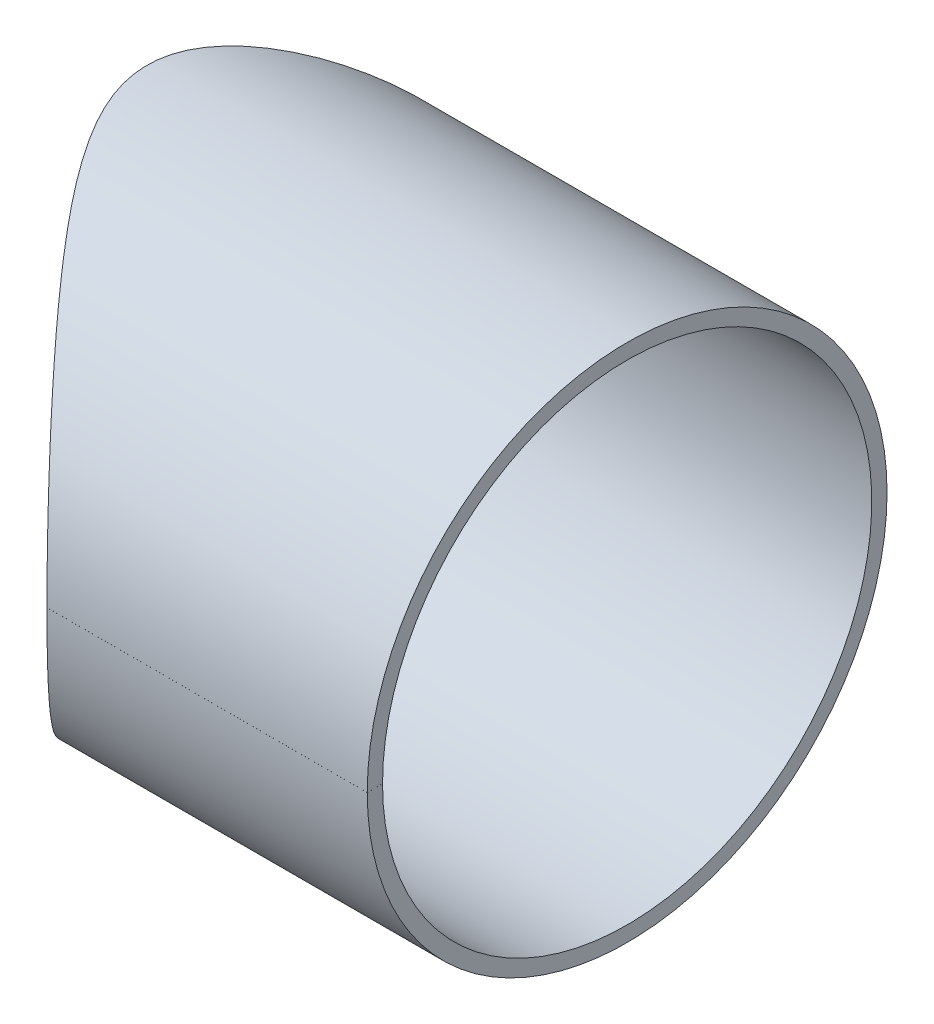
ISO-10303-21;
HEADER;
FILE_DESCRIPTION(('STEP AP214'),'2;1');
FILE_NAME('part.step','',(''),(''),'','','');
FILE_SCHEMA(('AUTOMOTIVE_DESIGN { 1 0 10303 214 1 1 1 1 }'));
ENDSEC;
DATA;
#1=APPLICATION_CONTEXT('core data for automotive mechanical design processes');
#2=APPLICATION_PROTOCOL_DEFINITION('international standard','automotive_design',2000,#1);
#3=PRODUCT_CONTEXT('',#1,'mechanical');
#4=PRODUCT('Part','Part','',(#3));
#5=PRODUCT_RELATED_PRODUCT_CATEGORY('part','',(#4));
#6=PRODUCT_DEFINITION_FORMATION('','',#4);
#7=PRODUCT_DEFINITION_CONTEXT('part definition',#1,'design');
#8=PRODUCT_DEFINITION('design','',#6,#7);
#9=PRODUCT_DEFINITION_SHAPE('','',#8);
#10=(LENGTH_UNIT() NAMED_UNIT(*) SI_UNIT(.MILLI.,.METRE.));
#11=(NAMED_UNIT(*) PLANE_ANGLE_UNIT() SI_UNIT($,.RADIAN.));
#12=(NAMED_UNIT(*) SI_UNIT($,.STERADIAN.) SOLID_ANGLE_UNIT());
#13=UNCERTAINTY_MEASURE_WITH_UNIT(LENGTH_MEASURE(1.E-05),#10,'distance_accuracy_value','');
#14=(GEOMETRIC_REPRESENTATION_CONTEXT(3) GLOBAL_UNCERTAINTY_ASSIGNED_CONTEXT((#13)) GLOBAL_UNIT_ASSIGNED_CONTEXT((#10,
#11,#12)) REPRESENTATION_CONTEXT('',''));
#15=CARTESIAN_POINT('',(0.,0.,0.));
#16=DIRECTION('',(0.,0.,1.));
#17=DIRECTION('',(1.,0.,0.));
#18=AXIS2_PLACEMENT_3D('',#15,#16,#17);
#19=CARTESIAN_POINT('',(120.,1.20375282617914E-11,0.));
#20=DIRECTION('',(-1.,-5.72767584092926E-13,0.));
#21=DIRECTION('',(5.72767584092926E-13,-1.,0.));
#22=AXIS2_PLACEMENT_3D('',#19,#20,#21);
#23=PLANE('',#22);
#24=DIRECTION('',(0.,9.80392154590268E-05,0.999999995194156));
#25=VECTOR('',#24,1.);
#26=CARTESIAN_POINT('',(120.,0.00485294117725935,49.4999997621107));
#27=LINE('',#26,#25);
#28=CARTESIAN_POINT('',(120.,0.00470588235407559,47.9999997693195));
#29=VERTEX_POINT('',#28);
#30=CARTESIAN_POINT('',(120.,0.00500000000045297,50.9999997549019));
#31=VERTEX_POINT('',#30);
#32=EDGE_CURVE('E13',#29,#31,#27,.T.);
#33=ORIENTED_EDGE('',*,*,#32,.F.);
#34=CARTESIAN_POINT('',(120.,1.20375282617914E-11,0.));
#35=DIRECTION('',(-1.,-5.72776156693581E-13,0.));
#36=DIRECTION('',(5.72776156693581E-13,-1.,0.));
#37=AXIS2_PLACEMENT_3D('',#34,#35,#36);
#38=CIRCLE('',#37,48.);
#39=CARTESIAN_POINT('',(120.,-0.00470588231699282,47.9999997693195));
#40=VERTEX_POINT('',#39);
#41=EDGE_CURVE('E242',#40,#29,#38,.F.);
#42=ORIENTED_EDGE('',*,*,#41,.F.);
#43=DIRECTION('',(0.,-9.80392151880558E-05,0.999999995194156));
#44=VECTOR('',#43,1.);
#45=CARTESIAN_POINT('',(120.,-0.00485294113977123,49.4999997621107));
#46=LINE('',#45,#44);
#47=CARTESIAN_POINT('',(120.,-0.00499999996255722,50.999999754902));
#48=VERTEX_POINT('',#47);
#49=EDGE_CURVE('E54',#40,#48,#46,.T.);
#50=ORIENTED_EDGE('',*,*,#49,.T.);
#51=CARTESIAN_POINT('',(120.,1.20375282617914E-11,0.));
#52=DIRECTION('',(-1.,-5.72776156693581E-13,0.));
#53=DIRECTION('',(5.72776156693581E-13,-1.,0.));
#54=AXIS2_PLACEMENT_3D('',#51,#52,#53);
#55=CIRCLE('',#54,51.);
#56=EDGE_CURVE('E109',#48,#31,#55,.F.);
#57=ORIENTED_EDGE('',*,*,#56,.T.);
#58=EDGE_LOOP('',(#33,#42,#50,#57));
#59=FACE_BOUND('',#58,.T.);
#60=ADVANCED_FACE('F42',(#59),#23,.F.);
#61=CARTESIAN_POINT('',(88.5749998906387,-0.00485294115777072,49.4999997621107));
#62=DIRECTION('',(-5.72776164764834E-13,0.999999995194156,9.80392151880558E-05));
#63=DIRECTION('',(-1.,-5.72776156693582E-13,0.));
#64=AXIS2_PLACEMENT_3D('',#61,#62,#63);
#65=PLANE('',#64);
#66=ORIENTED_EDGE('',*,*,#49,.F.);
#67=DIRECTION('',(-1.,-5.72776156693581E-13,0.));
#68=VECTOR('',#67,1.);
#69=CARTESIAN_POINT('',(444.979407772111,-0.00470588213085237,47.9999997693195));
#70=LINE('',#69,#68);
#71=CARTESIAN_POINT('',(57.1499997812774,-0.00470588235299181,47.9999997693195));
#72=VERTEX_POINT('',#71);
#73=EDGE_CURVE('E98',#40,#72,#70,.T.);
#74=ORIENTED_EDGE('',*,*,#73,.T.);
#75=CARTESIAN_POINT('',(57.1499997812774,-0.00499999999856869,50.9999997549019));
#76=CARTESIAN_POINT('',(57.1499997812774,-0.00470588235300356,47.9999997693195));
#77=B_SPLINE_CURVE_WITH_KNOTS('',1,(#75,#76),.UNSPECIFIED.,.F.,.F.,(2,2),(0.,1.),.UNSPECIFIED.);
#78=CARTESIAN_POINT('',(57.1499997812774,-0.0049999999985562,50.9999997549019));
#79=VERTEX_POINT('',#78);
#80=EDGE_CURVE('E92',#72,#79,#77,.F.);
#81=ORIENTED_EDGE('',*,*,#80,.T.);
#82=DIRECTION('',(-1.,-5.72776156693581E-13,0.));
#83=VECTOR('',#82,1.);
#84=CARTESIAN_POINT('',(444.979407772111,-0.00499999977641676,50.999999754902));
#85=LINE('',#84,#83);
#86=EDGE_CURVE('E96',#48,#79,#85,.T.);
#87=ORIENTED_EDGE('',*,*,#86,.F.);
#88=EDGE_LOOP('',(#66,#74,#81,#87));
#89=FACE_BOUND('',#88,.T.);
#90=ADVANCED_FACE('F95',(#89),#65,.T.);
#91=CARTESIAN_POINT('',(57.1499997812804,0.00499996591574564,50.9999997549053));
#92=CARTESIAN_POINT('',(57.1485789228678,0.464967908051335,50.999954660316));
#93=CARTESIAN_POINT('',(57.1441698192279,0.873500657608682,50.9937697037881));
#94=CARTESIAN_POINT('',(57.1330737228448,1.40906104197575,50.980843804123));
#95=CARTESIAN_POINT('',(57.1286266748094,1.57637315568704,50.9759194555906));
#96=CARTESIAN_POINT('',(57.1182127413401,1.91861429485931,50.964185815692));
#97=CARTESIAN_POINT('',(57.1122489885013,2.08947504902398,50.9574651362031));
#98=CARTESIAN_POINT('',(57.0786462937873,2.942437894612,50.9196288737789));
#99=CARTESIAN_POINT('',(57.0396200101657,3.62137289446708,50.8758298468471));
#100=CARTESIAN_POINT('',(56.8855974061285,5.65850818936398,50.7034407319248));
#101=CARTESIAN_POINT('',(56.7340810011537,7.01196143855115,50.5339081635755));
#102=CARTESIAN_POINT('',(56.3388934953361,9.69080061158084,50.0892389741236));
#103=CARTESIAN_POINT('',(56.0943125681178,11.0151688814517,49.814705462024));
#104=CARTESIAN_POINT('',(55.5126987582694,13.6467685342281,49.1589720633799));
#105=CARTESIAN_POINT('',(55.1759232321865,14.9520099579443,48.7780813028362));
#106=CARTESIAN_POINT('',(54.4085019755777,17.5402038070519,47.9082985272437));
#107=CARTESIAN_POINT('',(53.9762806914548,18.8294316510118,47.41718454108));
#108=CARTESIAN_POINT('',(53.0148168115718,21.3873842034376,46.3197223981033));
#109=CARTESIAN_POINT('',(52.4837309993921,22.6604440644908,45.7118348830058));
#110=CARTESIAN_POINT('',(51.3122807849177,25.2000194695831,44.3624457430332));
#111=CARTESIAN_POINT('',(50.6731889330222,26.4636339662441,43.6221431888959));
#112=CARTESIAN_POINT('',(49.2882717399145,28.9625711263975,42.0045803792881));
#113=CARTESIAN_POINT('',(48.5452368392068,30.1936564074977,41.1314577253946));
#114=CARTESIAN_POINT('',(46.9207458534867,32.6610097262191,39.2009202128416));
#115=CARTESIAN_POINT('',(46.0491171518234,33.8832437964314,38.1558363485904));
#116=CARTESIAN_POINT('',(44.8379429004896,35.4376591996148,36.6790974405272));
#117=CARTESIAN_POINT('',(44.5900139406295,35.7492464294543,36.3756220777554));
#118=CARTESIAN_POINT('',(44.0827678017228,36.3729711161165,35.7519436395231));
#119=CARTESIAN_POINT('',(43.8253746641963,36.6828708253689,35.4341310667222));
#120=CARTESIAN_POINT('',(43.0202283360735,37.6305469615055,34.4352226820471));
#121=CARTESIAN_POINT('',(42.4371268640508,38.2889161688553,33.7054163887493));
#122=CARTESIAN_POINT('',(41.6503284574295,39.1333242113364,32.7055262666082));
#123=CARTESIAN_POINT('',(41.4900726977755,39.3032688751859,32.5011669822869));
#124=CARTESIAN_POINT('',(41.2453449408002,39.5595311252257,32.1879122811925));
#125=CARTESIAN_POINT('',(41.163045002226,39.6451759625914,32.0823747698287));
#126=CARTESIAN_POINT('',(40.9969970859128,39.8168707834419,31.8690374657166));
#127=CARTESIAN_POINT('',(40.9128096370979,39.9034038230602,31.7607052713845));
#128=CARTESIAN_POINT('',(40.4411384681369,40.384304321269,31.152729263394));
#129=CARTESIAN_POINT('',(39.9389190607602,40.8859462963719,30.5022022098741));
#130=CARTESIAN_POINT('',(38.9982662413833,41.7780114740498,29.2550678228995));
#131=CARTESIAN_POINT('',(38.6534946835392,42.0984331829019,28.7940274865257));
#132=CARTESIAN_POINT('',(38.1835044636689,42.522455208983,28.157844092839));
#133=CARTESIAN_POINT('',(38.0871968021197,42.6087263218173,28.0271211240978));
#134=CARTESIAN_POINT('',(37.9004955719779,42.774935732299,27.7727915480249));
#135=CARTESIAN_POINT('',(37.8088978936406,42.8559491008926,27.6475865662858));
#136=CARTESIAN_POINT('',(37.5393636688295,43.0928903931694,27.2779849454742));
#137=CARTESIAN_POINT('',(37.3666859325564,43.2427211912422,27.0396040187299));
#138=CARTESIAN_POINT('',(36.5383559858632,43.9534636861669,25.8894375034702));
#139=CARTESIAN_POINT('',(35.9878799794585,44.3997661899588,25.1035198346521));
#140=CARTESIAN_POINT('',(35.4400199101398,44.8346715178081,24.3081283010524));
#141=CARTESIAN_POINT('',(35.3393665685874,44.9139978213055,24.1611275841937));
#142=CARTESIAN_POINT('',(35.1407696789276,45.069566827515,23.8696760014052));
#143=CARTESIAN_POINT('',(35.0427605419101,45.1458228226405,23.7251096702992));
#144=CARTESIAN_POINT('',(34.7526010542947,45.3701280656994,23.2949794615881));
#145=CARTESIAN_POINT('',(34.5643186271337,45.5137150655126,23.0129856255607));
#146=CARTESIAN_POINT('',(34.0149430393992,45.9275922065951,22.1819597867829));
#147=CARTESIAN_POINT('',(33.6693215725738,46.1810080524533,21.6479016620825));
#148=CARTESIAN_POINT('',(33.1818327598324,46.5310855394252,20.8791131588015));
#149=CARTESIAN_POINT('',(33.024493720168,46.6427680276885,20.628228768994));
#150=CARTESIAN_POINT('',(32.720130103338,46.8567008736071,20.1375573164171));
#151=CARTESIAN_POINT('',(32.5738539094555,46.95845323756,19.8989844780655));
#152=CARTESIAN_POINT('',(32.1430573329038,47.2553933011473,19.1883156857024));
#153=CARTESIAN_POINT('',(31.8673397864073,47.4416362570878,18.7224745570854));
#154=CARTESIAN_POINT('',(31.0746276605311,47.9678881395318,17.3505424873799));
#155=CARTESIAN_POINT('',(30.5920735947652,48.2754455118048,16.4701069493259));
#156=CARTESIAN_POINT('',(29.7188068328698,48.8177646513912,14.7854292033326));
#157=CARTESIAN_POINT('',(29.3204153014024,49.0574267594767,13.9663835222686));
#158=CARTESIAN_POINT('',(28.5903073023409,49.4865280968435,12.3601992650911));
#159=CARTESIAN_POINT('',(28.2601538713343,49.6749927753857,11.576069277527));
#160=CARTESIAN_POINT('',(27.6696481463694,50.0062442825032,10.0491701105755));
#161=CARTESIAN_POINT('',(27.4050454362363,50.1517022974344,9.29469578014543));
#162=CARTESIAN_POINT('',(26.9306781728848,50.4077951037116,7.78709225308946));
#163=CARTESIAN_POINT('',(26.7239262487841,50.5175605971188,7.03823124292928));
#164=CARTESIAN_POINT('',(26.3712858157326,50.7024053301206,5.55218168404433));
#165=CARTESIAN_POINT('',(26.2253475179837,50.7775166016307,4.81546537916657));
#166=CARTESIAN_POINT('',(25.8806580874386,50.9546632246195,2.60804368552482));
#167=CARTESIAN_POINT('',(25.7745397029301,51.007707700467,1.14888591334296));
#168=CARTESIAN_POINT('',(25.8090113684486,50.9904997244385,-1.75360244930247));
#169=CARTESIAN_POINT('',(25.9489868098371,50.9198437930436,-3.21636821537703));
#170=CARTESIAN_POINT('',(26.3430593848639,50.7165984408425,-5.41945769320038));
#171=CARTESIAN_POINT('',(26.5051274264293,50.6325447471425,-6.15532569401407));
#172=CARTESIAN_POINT('',(26.8809891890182,50.4336488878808,-7.61509565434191));
#173=CARTESIAN_POINT('',(27.0960578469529,50.3192331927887,-8.33810174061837));
#174=CARTESIAN_POINT('',(27.4588157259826,50.1216022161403,-9.43198196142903));
#175=CARTESIAN_POINT('',(27.5864404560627,50.0514289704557,-9.79767581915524));
#176=CARTESIAN_POINT('',(27.8551007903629,49.9022896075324,-10.5309774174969));
#177=CARTESIAN_POINT('',(27.9959666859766,49.8234590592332,-10.8981395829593));
#178=CARTESIAN_POINT('',(28.4446633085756,49.569667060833,-12.0180773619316));
#179=CARTESIAN_POINT('',(28.7766509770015,49.3784141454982,-12.7841053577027));
#180=CARTESIAN_POINT('',(29.3239173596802,49.0539412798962,-13.9598040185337));
#181=CARTESIAN_POINT('',(29.514553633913,48.9395167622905,-14.356141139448));
#182=CARTESIAN_POINT('',(29.9122544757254,48.6973701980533,-15.1572169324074));
#183=CARTESIAN_POINT('',(30.1185346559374,48.5701663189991,-15.5604690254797));
#184=CARTESIAN_POINT('',(30.7714095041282,48.1614000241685,-16.7998975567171));
#185=CARTESIAN_POINT('',(31.2500896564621,47.853681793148,-17.6620166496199));
#186=CARTESIAN_POINT('',(32.033255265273,47.3297137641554,-19.0033843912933));
#187=CARTESIAN_POINT('',(32.305168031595,47.1446537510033,-19.4585238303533));
#188=CARTESIAN_POINT('',(32.870708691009,46.7520743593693,-20.3837207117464));
#189=CARTESIAN_POINT('',(33.1727203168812,46.5388502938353,-20.8672895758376));
#190=CARTESIAN_POINT('',(33.8163348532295,46.0734526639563,-21.8756787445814));
#191=CARTESIAN_POINT('',(34.1577539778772,45.8214028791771,-22.4002054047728));
#192=CARTESIAN_POINT('',(34.6993004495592,45.4108404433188,-23.2152560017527));
#193=CARTESIAN_POINT('',(34.8847189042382,45.2685695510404,-23.4916454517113));
#194=CARTESIAN_POINT('',(35.1702010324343,45.0465882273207,-23.9129690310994));
#195=CARTESIAN_POINT('',(35.2658063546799,44.9717739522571,-24.0534048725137));
#196=CARTESIAN_POINT('',(35.4628075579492,44.8166084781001,-24.3412888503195));
#197=CARTESIAN_POINT('',(35.5680516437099,44.7332519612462,-24.494292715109));
#198=CARTESIAN_POINT('',(36.1279894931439,44.2861762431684,-25.3037922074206));
#199=CARTESIAN_POINT('',(36.6838355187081,43.8321636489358,-26.0943228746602));
#200=CARTESIAN_POINT('',(37.5135127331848,43.1153291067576,-27.2422771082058));
#201=CARTESIAN_POINT('',(37.6861916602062,42.9644606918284,-27.4798188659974));
#202=CARTESIAN_POINT('',(38.0450364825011,42.6468642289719,-27.9701680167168));
#203=CARTESIAN_POINT('',(38.235409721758,42.4763101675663,-28.2285153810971));
#204=CARTESIAN_POINT('',(38.7761287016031,41.9851411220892,-28.9584521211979));
#205=CARTESIAN_POINT('',(39.1066753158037,41.6762736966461,-29.3994636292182));
#206=CARTESIAN_POINT('',(40.0085170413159,40.8171417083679,-30.5928414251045));
#207=CARTESIAN_POINT('',(40.4900140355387,40.3350801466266,-31.2159426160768));
#208=CARTESIAN_POINT('',(40.9422217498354,39.8732209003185,-31.7985591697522));
#209=CARTESIAN_POINT('',(41.023002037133,39.7900685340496,-31.9024803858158));
#210=CARTESIAN_POINT('',(41.1847967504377,39.6225693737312,-32.1102756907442));
#211=CARTESIAN_POINT('',(41.2650078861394,39.5390109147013,-32.2131016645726));
#212=CARTESIAN_POINT('',(41.5035826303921,39.2889684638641,-32.5183973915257));
#213=CARTESIAN_POINT('',(41.6598875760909,39.1231178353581,-32.7176848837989));
#214=CARTESIAN_POINT('',(42.4276878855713,38.2988540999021,-33.6933499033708));
#215=CARTESIAN_POINT('',(42.9980099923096,37.6555426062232,-34.4074042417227));
#216=CARTESIAN_POINT('',(43.7876159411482,36.7278334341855,-35.3874072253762));
#217=CARTESIAN_POINT('',(44.0397941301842,36.4249070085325,-35.6989165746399));
#218=CARTESIAN_POINT('',(44.5370296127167,35.8151544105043,-36.310621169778));
#219=CARTESIAN_POINT('',(44.7802323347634,35.5104802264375,-36.6085021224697));
#220=CARTESIAN_POINT('',(45.493595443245,34.5982637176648,-37.4788831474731));
#221=CARTESIAN_POINT('',(45.9475107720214,33.9925482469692,-38.0281148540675));
#222=CARTESIAN_POINT('',(46.8120212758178,32.7918649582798,-39.0682025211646));
#223=CARTESIAN_POINT('',(47.2272341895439,32.1905243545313,-39.5646399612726));
#224=CARTESIAN_POINT('',(48.0275205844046,30.9838088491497,-40.5165914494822));
#225=CARTESIAN_POINT('',(48.4119570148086,30.3793146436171,-40.9713412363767));
#226=CARTESIAN_POINT('',(49.1494163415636,29.1712146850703,-41.8400979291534));
#227=CARTESIAN_POINT('',(49.503705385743,28.5654676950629,-42.255731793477));
#228=CARTESIAN_POINT('',(50.5303945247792,26.7339235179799,-43.456053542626));
#229=CARTESIAN_POINT('',(51.163747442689,25.4987894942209,-44.1905459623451));
#230=CARTESIAN_POINT('',(52.3282402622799,23.0153707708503,-45.5333430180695));
#231=CARTESIAN_POINT('',(52.8587775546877,21.7684574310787,-46.1410606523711));
#232=CARTESIAN_POINT('',(53.8201967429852,19.2691617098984,-47.2394181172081));
#233=CARTESIAN_POINT('',(54.2544598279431,18.0090155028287,-47.7333269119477));
#234=CARTESIAN_POINT('',(55.0300929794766,15.4778873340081,-48.6130655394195));
#235=CARTESIAN_POINT('',(55.3721716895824,14.2040098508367,-49.0002041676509));
#236=CARTESIAN_POINT('',(55.9698090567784,11.627083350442,-49.6747907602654));
#237=CARTESIAN_POINT('',(56.2251929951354,10.3271992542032,-49.9611414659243));
#238=CARTESIAN_POINT('',(56.8526778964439,6.40252683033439,-50.6663049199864));
#239=CARTESIAN_POINT('',(57.0876097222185,3.75322658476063,-50.930717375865));
#240=CARTESIAN_POINT('',(57.164920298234,-0.221460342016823,-51.0167337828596));
#241=CARTESIAN_POINT('',(57.1447370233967,-1.54719080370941,-50.9939149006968));
#242=CARTESIAN_POINT('',(57.0103580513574,-4.20614915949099,-50.8436964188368));
#243=CARTESIAN_POINT('',(56.8964458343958,-5.53749793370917,-50.7162199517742));
#244=CARTESIAN_POINT('',(56.5751759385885,-8.19549830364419,-50.355065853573));
#245=CARTESIAN_POINT('',(56.3683308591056,-9.51698199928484,-50.1219808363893));
#246=CARTESIAN_POINT('',(55.8631874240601,-12.128863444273,-49.5547836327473));
#247=CARTESIAN_POINT('',(55.5661473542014,-13.4254881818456,-49.2194292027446));
#248=CARTESIAN_POINT('',(54.883130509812,-15.9918564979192,-48.4464288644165));
#249=CARTESIAN_POINT('',(54.4970882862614,-17.26201158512,-48.0090508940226));
#250=CARTESIAN_POINT('',(53.6294642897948,-19.7937097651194,-47.0218573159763));
#251=CARTESIAN_POINT('',(53.1502073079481,-21.0484812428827,-46.4747612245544));
#252=CARTESIAN_POINT('',(52.0872536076,-23.5549867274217,-45.2559895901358));
#253=CARTESIAN_POINT('',(51.5041329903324,-24.8052708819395,-44.5845142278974));
#254=CARTESIAN_POINT('',(50.2346042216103,-27.2854287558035,-43.1113181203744));
#255=CARTESIAN_POINT('',(49.5496312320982,-28.5128372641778,-42.3113662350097));
#256=CARTESIAN_POINT('',(48.0703354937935,-30.9415984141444,-40.5690903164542));
#257=CARTESIAN_POINT('',(47.2681458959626,-32.1567642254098,-39.6167652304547));
#258=CARTESIAN_POINT('',(45.9665777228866,-33.9668430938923,-38.05114930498));
#259=CARTESIAN_POINT('',(45.5108677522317,-34.5756295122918,-37.4998513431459));
#260=CARTESIAN_POINT('',(44.794521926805,-35.4924778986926,-36.6259779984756));
#261=CARTESIAN_POINT('',(44.5502765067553,-35.7987001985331,-36.3268674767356));
#262=CARTESIAN_POINT('',(44.0508587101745,-36.4115472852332,-35.7125672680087));
#263=CARTESIAN_POINT('',(43.7975401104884,-36.7160172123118,-35.3996906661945));
#264=CARTESIAN_POINT('',(43.0047980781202,-37.6478632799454,-34.4159042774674));
#265=CARTESIAN_POINT('',(42.4321884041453,-38.2939570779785,-33.6990418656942));
#266=CARTESIAN_POINT('',(41.6612825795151,-39.1216408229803,-32.7194591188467));
#267=CARTESIAN_POINT('',(41.5043442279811,-39.2881724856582,-32.5193677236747));
#268=CARTESIAN_POINT('',(41.2648009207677,-39.5392301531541,-32.2128347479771));
#269=CARTESIAN_POINT('',(41.1842638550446,-39.6231259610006,-32.1095911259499));
#270=CARTESIAN_POINT('',(41.0218111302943,-39.7912973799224,-31.9009499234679));
#271=CARTESIAN_POINT('',(40.9406463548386,-39.874838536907,-31.7965341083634));
#272=CARTESIAN_POINT('',(40.486186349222,-40.3389454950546,-31.2110036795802));
#273=CARTESIAN_POINT('',(40.0022366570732,-40.8233751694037,-30.5846847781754));
#274=CARTESIAN_POINT('',(39.0957395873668,-41.6865610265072,-29.3849171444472));
#275=CARTESIAN_POINT('',(38.7634784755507,-41.9968612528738,-28.941514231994));
#276=CARTESIAN_POINT('',(38.2199436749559,-42.4902369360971,-28.2075639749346));
#277=CARTESIAN_POINT('',(38.0291436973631,-42.6610419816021,-27.948541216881));
#278=CARTESIAN_POINT('',(37.6700417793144,-42.978632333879,-27.4576514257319));
#279=CARTESIAN_POINT('',(37.4972730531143,-43.1294649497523,-27.2198929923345));
#280=CARTESIAN_POINT('',(36.6673405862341,-43.8459716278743,-26.0711318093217));
#281=CARTESIAN_POINT('',(36.1119103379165,-44.2992533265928,-25.2808456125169));
#282=CARTESIAN_POINT('',(35.4415385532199,-44.8341403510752,-24.3112342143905));
#283=CARTESIAN_POINT('',(35.2511012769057,-44.9837763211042,-24.0325007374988));
#284=CARTESIAN_POINT('',(34.8697437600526,-45.2801107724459,-23.4694011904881));
#285=CARTESIAN_POINT('',(34.6839963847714,-45.4225351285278,-23.1923739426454));
#286=CARTESIAN_POINT('',(34.1415484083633,-45.8334866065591,-22.3755029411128));
#287=CARTESIAN_POINT('',(33.7996419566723,-46.0857007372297,-21.8498868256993));
#288=CARTESIAN_POINT('',(33.1552801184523,-46.5512733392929,-20.839585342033));
#289=CARTESIAN_POINT('',(32.8533549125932,-46.7642722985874,-20.3557517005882));
#290=CARTESIAN_POINT('',(32.2867820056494,-47.1572551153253,-19.4279973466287));
#291=CARTESIAN_POINT('',(32.0144261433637,-47.3424587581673,-18.9716390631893));
#292=CARTESIAN_POINT('',(31.230150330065,-47.8667070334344,-17.6268067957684));
#293=CARTESIAN_POINT('',(30.7510221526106,-48.1744116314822,-16.7626346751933));
#294=CARTESIAN_POINT('',(30.097913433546,-48.5829450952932,-15.5205479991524));
#295=CARTESIAN_POINT('',(29.8914448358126,-48.7101464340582,-15.1161025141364));
#296=CARTESIAN_POINT('',(29.4945354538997,-48.9515036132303,-14.3152092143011));
#297=CARTESIAN_POINT('',(29.3047938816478,-49.0652216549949,-13.9200338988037));
#298=CARTESIAN_POINT('',(28.942736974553,-49.2796535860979,-13.14074055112));
#299=CARTESIAN_POINT('',(28.7706809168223,-49.3802508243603,-12.7572516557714));
#300=CARTESIAN_POINT('',(28.438802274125,-49.5722937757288,-11.9893423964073));
#301=CARTESIAN_POINT('',(28.279604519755,-49.663312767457,-11.6064011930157));
#302=CARTESIAN_POINT('',(27.5173235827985,-50.094015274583,-9.69745186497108));
#303=CARTESIAN_POINT('',(27.0218241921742,-50.3601467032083,-8.19012491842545));
#304=CARTESIAN_POINT('',(26.4635278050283,-50.6544629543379,-5.97335863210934));
#305=CARTESIAN_POINT('',(26.3075285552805,-50.7349932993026,-5.24369509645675));
#306=CARTESIAN_POINT('',(26.0560754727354,-50.8645939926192,-3.78536145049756));
#307=CARTESIAN_POINT('',(25.9606042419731,-50.9134407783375,-3.05763539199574));
#308=CARTESIAN_POINT('',(25.8301724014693,-50.9798675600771,-1.60645250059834));
#309=CARTESIAN_POINT('',(25.7952117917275,-50.9974477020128,-0.882995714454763));
#310=CARTESIAN_POINT('',(25.7902124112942,-50.9998850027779,-0.117296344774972));
#311=CARTESIAN_POINT('',(25.7900365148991,-50.9999686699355,-0.0722661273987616));
#312=CARTESIAN_POINT('',(25.7899210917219,-51.0000167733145,0.0177721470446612));
#313=CARTESIAN_POINT('',(25.7899866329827,-50.999978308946,0.0674074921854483));
#314=CARTESIAN_POINT('',(25.790610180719,-50.9996497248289,0.212257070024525));
#315=CARTESIAN_POINT('',(25.7915731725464,-50.9991562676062,0.308881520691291));
#316=CARTESIAN_POINT('',(25.7961040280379,-50.9968497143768,0.59892437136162));
#317=CARTESIAN_POINT('',(25.8013137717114,-50.9942104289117,0.792512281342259));
#318=CARTESIAN_POINT('',(25.8235105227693,-50.9829642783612,1.3739160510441));
#319=CARTESIAN_POINT('',(25.8470650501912,-50.9710289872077,1.76237213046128));
#320=CARTESIAN_POINT('',(25.9439987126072,-50.9217258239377,2.92999065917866));
#321=CARTESIAN_POINT('',(26.0436479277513,-50.8708583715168,3.71140623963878));
#322=CARTESIAN_POINT('',(26.3129999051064,-50.7321988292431,5.27851964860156));
#323=CARTESIAN_POINT('',(26.4831940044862,-50.6441959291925,6.06493700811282));
#324=CARTESIAN_POINT('',(26.8820844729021,-50.4331981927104,7.62302841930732));
#325=CARTESIAN_POINT('',(27.1122923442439,-50.31067109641,8.3941148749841));
#326=CARTESIAN_POINT('',(27.6330546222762,-50.0263721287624,9.94921516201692));
#327=CARTESIAN_POINT('',(27.9215089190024,-49.8663229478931,10.7248704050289));
#328=CARTESIAN_POINT('',(28.5739135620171,-49.4955785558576,12.3231778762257));
#329=CARTESIAN_POINT('',(28.9371527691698,-49.2849221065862,13.1438034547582));
#330=CARTESIAN_POINT('',(29.7377049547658,-48.8058695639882,14.8239742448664));
#331=CARTESIAN_POINT('',(30.1714608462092,-48.5400387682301,15.6768063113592));
#332=CARTESIAN_POINT('',(31.1406212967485,-47.9242917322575,17.4688259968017));
#333=CARTESIAN_POINT('',(31.6740010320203,-47.5751179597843,18.4039879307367));
#334=CARTESIAN_POINT('',(32.5472698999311,-46.9778701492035,19.8583577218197));
#335=CARTESIAN_POINT('',(32.8496760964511,-46.7673622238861,20.3504071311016));
#336=CARTESIAN_POINT('',(33.5046563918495,-46.3005953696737,21.3911221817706));
#337=CARTESIAN_POINT('',(33.8540621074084,-46.0463748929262,21.9346231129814));
#338=CARTESIAN_POINT('',(34.4110440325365,-45.6297691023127,22.7820818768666));
#339=CARTESIAN_POINT('',(34.6021835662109,-45.4850185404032,23.0699309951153));
#340=CARTESIAN_POINT('',(34.8971112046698,-45.2585446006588,23.509387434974));
#341=CARTESIAN_POINT('',(34.9967901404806,-45.1814951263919,23.6571530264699));
#342=CARTESIAN_POINT('',(35.1988874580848,-45.0241907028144,23.9551798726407));
#343=CARTESIAN_POINT('',(35.2995399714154,-44.945318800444,24.1028931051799));
#344=CARTESIAN_POINT('',(35.8314540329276,-44.5256535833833,24.8789948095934));
#345=CARTESIAN_POINT('',(36.376374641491,-44.0876185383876,25.6604647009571));
#346=CARTESIAN_POINT('',(37.3728395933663,-43.2390766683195,27.0495219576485));
#347=CARTESIAN_POINT('',(37.7348419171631,-42.9241636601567,27.5485473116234));
#348=CARTESIAN_POINT('',(38.2246539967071,-42.4854692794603,28.2136543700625));
#349=CARTESIAN_POINT('',(38.3225453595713,-42.3971692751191,28.3461442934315));
#350=CARTESIAN_POINT('',(38.5124114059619,-42.2246897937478,28.6024374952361));
#351=CARTESIAN_POINT('',(38.6052686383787,-42.1397339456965,28.7274200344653));
#352=CARTESIAN_POINT('',(38.8776129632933,-41.888949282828,29.0930109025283));
#353=CARTESIAN_POINT('',(39.0508726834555,-41.727207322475,29.3242636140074));
#354=CARTESIAN_POINT('',(39.8756554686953,-40.9485766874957,30.4199004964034));
#355=CARTESIAN_POINT('',(40.4026310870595,-40.4230963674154,31.1029359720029));
#356=CARTESIAN_POINT('',(40.8952873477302,-39.9213712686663,31.7381525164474));
#357=CARTESIAN_POINT('',(40.9831696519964,-39.8311146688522,31.8512520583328));
#358=CARTESIAN_POINT('',(41.1544923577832,-39.6540656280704,32.0714052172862));
#359=CARTESIAN_POINT('',(41.2393799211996,-39.5657600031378,32.1802732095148));
#360=CARTESIAN_POINT('',(41.4917212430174,-39.301571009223,32.5032907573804));
#361=CARTESIAN_POINT('',(41.6568536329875,-39.1264160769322,32.7138538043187));
#362=CARTESIAN_POINT('',(42.1429653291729,-38.6044138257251,33.3315150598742));
#363=CARTESIAN_POINT('',(42.4546591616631,-38.2610376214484,33.7245848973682));
#364=CARTESIAN_POINT('',(43.0532855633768,-37.5862556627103,34.4750346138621));
#365=CARTESIAN_POINT('',(43.3402181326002,-37.2548494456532,34.8324154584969));
#366=CARTESIAN_POINT('',(43.8893220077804,-36.6064577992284,35.5132119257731));
#367=CARTESIAN_POINT('',(44.1533607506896,-36.287346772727,35.8389907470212));
#368=CARTESIAN_POINT('',(44.9327322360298,-35.3248146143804,36.7964216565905));
#369=CARTESIAN_POINT('',(45.4280694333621,-34.684679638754,37.3992030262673));
#370=CARTESIAN_POINT('',(46.3702562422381,-33.414784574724,38.53802745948));
#371=CARTESIAN_POINT('',(46.816277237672,-32.7863292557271,39.0732878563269));
#372=CARTESIAN_POINT('',(47.677891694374,-31.5201442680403,40.1016921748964));
#373=CARTESIAN_POINT('',(48.0912974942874,-30.8853158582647,40.5921017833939));
#374=CARTESIAN_POINT('',(48.8833062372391,-29.6159606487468,41.5272962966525));
#375=CARTESIAN_POINT('',(49.2615026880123,-28.9822091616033,41.9716989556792));
#376=CARTESIAN_POINT('',(50.3569572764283,-27.0632924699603,43.2544338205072));
#377=CARTESIAN_POINT('',(51.0308640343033,-25.7675648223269,44.0367927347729));
#378=CARTESIAN_POINT('',(52.2658849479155,-23.1608139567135,45.4618874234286));
#379=CARTESIAN_POINT('',(52.8263221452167,-21.8514463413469,46.1039140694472));
#380=CARTESIAN_POINT('',(53.83725791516,-19.2261456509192,47.2589877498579));
#381=CARTESIAN_POINT('',(54.2921033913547,-17.8994889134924,47.7765703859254));
#382=CARTESIAN_POINT('',(55.1005495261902,-15.2295057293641,48.6934752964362));
#383=CARTESIAN_POINT('',(55.4541501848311,-13.8861816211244,49.0928013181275));
#384=CARTESIAN_POINT('',(56.0601066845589,-11.1935628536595,49.7758308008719));
#385=CARTESIAN_POINT('',(56.3121550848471,-9.84592158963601,50.0595253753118));
#386=CARTESIAN_POINT('',(56.7199165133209,-7.12880534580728,50.5180995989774));
#387=CARTESIAN_POINT('',(56.8753917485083,-5.76308756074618,50.6920271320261));
#388=CARTESIAN_POINT('',(57.0341537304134,-3.70598494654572,50.8698277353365));
#389=CARTESIAN_POINT('',(57.0745647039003,-3.0212260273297,50.915141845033));
#390=CARTESIAN_POINT('',(57.1096907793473,-2.15657702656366,50.9546773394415));
#391=CARTESIAN_POINT('',(57.115950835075,-1.98303286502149,50.9617302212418));
#392=CARTESIAN_POINT('',(57.1269406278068,-1.63473250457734,50.9740916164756));
#393=CARTESIAN_POINT('',(57.1316746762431,-1.46392288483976,50.9793054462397));
#394=CARTESIAN_POINT('',(57.1435510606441,-0.921982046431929,50.9929462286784));
#395=CARTESIAN_POINT('',(57.1483398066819,-0.49587304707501,50.9999516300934));
#396=CARTESIAN_POINT('',(57.1499997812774,-0.00499999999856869,50.9999997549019));
#397=CARTESIAN_POINT('',(57.1499997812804,0.00470585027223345,47.9999997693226));
#398=CARTESIAN_POINT('',(57.1485789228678,0.437616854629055,47.9999573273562));
#399=CARTESIAN_POINT('',(57.1441698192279,0.822118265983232,47.9941361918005));
#400=CARTESIAN_POINT('',(57.1330737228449,1.32617509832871,47.9819706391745));
#401=CARTESIAN_POINT('',(57.1286266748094,1.48364532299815,47.9773359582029));
#402=CARTESIAN_POINT('',(57.1182127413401,1.80575463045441,47.966292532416));
#403=CARTESIAN_POINT('',(57.1122489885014,1.96656475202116,47.9599671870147));
#404=CARTESIAN_POINT('',(57.0786462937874,2.76935331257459,47.9243565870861));
#405=CARTESIAN_POINT('',(57.0396200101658,3.40835095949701,47.8831339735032));
#406=CARTESIAN_POINT('',(56.8855974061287,5.3256547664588,47.7208853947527));
#407=CARTESIAN_POINT('',(56.7340810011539,6.59949311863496,47.561325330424));
#408=CARTESIAN_POINT('',(56.3388934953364,9.12075351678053,47.1428131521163));
#409=CARTESIAN_POINT('',(56.0943125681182,10.3672177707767,46.8844286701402));
#410=CARTESIAN_POINT('',(55.5126987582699,12.8440174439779,46.2672678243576));
#411=CARTESIAN_POINT('',(55.175923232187,14.0724799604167,45.9087824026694));
#412=CARTESIAN_POINT('',(54.4085019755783,16.5084271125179,45.0901633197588));
#413=CARTESIAN_POINT('',(53.9762806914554,17.7218180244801,44.6279383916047));
#414=CARTESIAN_POINT('',(53.0148168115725,20.1293027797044,43.5950328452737));
#415=CARTESIAN_POINT('',(52.4837309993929,21.327476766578,43.0229034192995));
#416=CARTESIAN_POINT('',(51.3122807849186,23.7176653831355,41.75289011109));
#417=CARTESIAN_POINT('',(50.6731889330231,24.906949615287,41.0561347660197));
#418=CARTESIAN_POINT('',(49.2882717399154,27.2588904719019,39.5337227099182));
#419=CARTESIAN_POINT('',(48.5452368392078,28.4175589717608,38.7119602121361));
#420=CARTESIAN_POINT('',(46.9207458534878,30.7397738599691,36.8949837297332));
#421=CARTESIAN_POINT('',(46.0491171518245,31.8901118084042,35.9113753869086));
#422=CARTESIAN_POINT('',(44.8379429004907,33.3530910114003,34.5215034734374));
#423=CARTESIAN_POINT('',(44.5900139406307,33.6463495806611,34.2358796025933));
#424=CARTESIAN_POINT('',(44.082767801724,34.2333845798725,33.6488881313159));
#425=CARTESIAN_POINT('',(43.8253746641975,34.525054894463,33.3497704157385));
#426=CARTESIAN_POINT('',(43.0202283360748,35.4169853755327,32.4096213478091));
#427=CARTESIAN_POINT('',(42.4371268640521,36.0366269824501,31.7227448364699));
#428=CARTESIAN_POINT('',(41.6503284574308,36.8313639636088,30.7816717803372));
#429=CARTESIAN_POINT('',(41.4900726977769,36.991311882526,30.5893336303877));
#430=CARTESIAN_POINT('',(41.2453449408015,37.2324998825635,30.2945056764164));
#431=CARTESIAN_POINT('',(41.1630450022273,37.3131067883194,30.1951762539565));
#432=CARTESIAN_POINT('',(40.9969970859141,37.4747019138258,29.9943882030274));
#433=CARTESIAN_POINT('',(40.9128096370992,37.5561447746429,29.8924284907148));
#434=CARTESIAN_POINT('',(40.4411384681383,38.0087570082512,29.320215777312));
#435=CARTESIAN_POINT('',(39.9389190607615,38.4808906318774,28.707955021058));
#436=CARTESIAN_POINT('',(38.9982662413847,39.3204813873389,27.534181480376));
#437=CARTESIAN_POINT('',(38.6534946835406,39.6220547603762,27.1002611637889));
#438=CARTESIAN_POINT('',(38.1835044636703,40.0211343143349,26.501500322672));
#439=CARTESIAN_POINT('',(38.0871968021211,40.102330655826,26.3784669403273));
#440=CARTESIAN_POINT('',(37.9004955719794,40.2587630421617,26.1390979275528));
#441=CARTESIAN_POINT('',(37.808897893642,40.3350109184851,26.0212579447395));
#442=CARTESIAN_POINT('',(37.539363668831,40.5580144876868,25.6733975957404));
#443=CARTESIAN_POINT('',(37.3666859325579,40.6990317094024,25.4490390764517));
#444=CARTESIAN_POINT('',(36.5383559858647,41.3679658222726,24.3665294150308));
#445=CARTESIAN_POINT('',(35.98787997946,41.7880152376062,23.6268421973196));
#446=CARTESIAN_POINT('',(35.4400199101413,42.1973378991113,22.8782384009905));
#447=CARTESIAN_POINT('',(35.3393665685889,42.2719979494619,22.7398847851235));
#448=CARTESIAN_POINT('',(35.1407696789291,42.4184158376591,22.4655774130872));
#449=CARTESIAN_POINT('',(35.0427605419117,42.4901861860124,22.329514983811));
#450=CARTESIAN_POINT('',(34.7526010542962,42.7012970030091,21.9246865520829));
#451=CARTESIAN_POINT('',(34.5643186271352,42.8364377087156,21.659280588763));
#452=CARTESIAN_POINT('',(34.0149430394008,43.2259691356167,20.8771386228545));
#453=CARTESIAN_POINT('',(33.6693215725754,43.4644781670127,20.37449568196));
#454=CARTESIAN_POINT('',(33.1818327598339,43.7939628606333,19.6509300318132));
#455=CARTESIAN_POINT('',(33.0244937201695,43.8990757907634,19.4148035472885));
#456=CARTESIAN_POINT('',(32.7201301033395,44.100424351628,18.9529951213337));
#457=CARTESIAN_POINT('',(32.5738539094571,44.1961912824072,18.7284559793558));
#458=CARTESIAN_POINT('',(32.1430573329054,44.4756642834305,18.0595912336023));
#459=CARTESIAN_POINT('',(31.8673397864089,44.6509517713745,17.6211525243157));
#460=CARTESIAN_POINT('',(31.0746276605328,45.1462476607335,16.3299223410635));
#461=CARTESIAN_POINT('',(30.5920735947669,45.4357134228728,15.5012771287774));
#462=CARTESIAN_POINT('',(29.7188068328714,45.9461314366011,13.9156980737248));
#463=CARTESIAN_POINT('',(29.3204153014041,46.1716957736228,13.1448315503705));
#464=CARTESIAN_POINT('',(28.5903073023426,46.5755558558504,11.6331287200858));
#465=CARTESIAN_POINT('',(28.260153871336,46.7529343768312,10.8951240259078));
#466=CARTESIAN_POINT('',(27.6696481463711,47.0647005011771,9.45804245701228));
#467=CARTESIAN_POINT('',(27.405045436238,47.2016021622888,8.74794896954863));
#468=CARTESIAN_POINT('',(26.9306781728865,47.4426306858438,7.32902800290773));
#469=CARTESIAN_POINT('',(26.7239262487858,47.5459393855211,6.62421764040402));
#470=CARTESIAN_POINT('',(26.3712858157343,47.7199108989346,5.22558276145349));
#471=CARTESIAN_POINT('',(26.2253475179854,47.7906038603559,4.53220270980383));
#472=CARTESIAN_POINT('',(25.8806580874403,47.9573300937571,2.45462935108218));
#473=CARTESIAN_POINT('',(25.7745397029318,48.0072543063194,1.08130438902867));
#474=CARTESIAN_POINT('',(25.8090113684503,47.9910585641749,-1.65044936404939));
#475=CARTESIAN_POINT('',(25.9489868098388,47.9245588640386,-3.02717008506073));
#476=CARTESIAN_POINT('',(26.3430593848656,47.7332691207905,-5.10066606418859));
#477=CARTESIAN_POINT('',(26.505127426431,47.654159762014,-5.79324771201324));
#478=CARTESIAN_POINT('',(26.8809891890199,47.4669636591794,-7.16714885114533));
#479=CARTESIAN_POINT('',(27.0960578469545,47.3592782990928,-7.84762516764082));
#480=CARTESIAN_POINT('',(27.4588157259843,47.1732726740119,-8.87715949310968));
#481=CARTESIAN_POINT('',(27.5864404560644,47.1072272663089,-9.22134194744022));
#482=CARTESIAN_POINT('',(27.8551007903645,46.9668608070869,-9.91150815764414));
#483=CARTESIAN_POINT('',(27.9959666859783,46.8926673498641,-10.2570725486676));
#484=CARTESIAN_POINT('',(28.4446633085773,46.6538042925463,-11.3111316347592));
#485=CARTESIAN_POINT('',(28.7766509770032,46.4738015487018,-12.0320991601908));
#486=CARTESIAN_POINT('',(29.3239173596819,46.1684153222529,-13.138639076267));
#487=CARTESIAN_POINT('',(29.5145536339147,46.060721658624,-13.5116622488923));
#488=CARTESIAN_POINT('',(29.912254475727,45.8328190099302,-14.2656159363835));
#489=CARTESIAN_POINT('',(30.118534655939,45.7130977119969,-14.6451473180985));
#490=CARTESIAN_POINT('',(30.7714095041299,45.3283764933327,-15.8116682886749));
#491=CARTESIAN_POINT('',(31.2500896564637,45.0387593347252,-16.6230744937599));
#492=CARTESIAN_POINT('',(32.0332552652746,44.5456129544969,-17.8855382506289));
#493=CARTESIAN_POINT('',(32.3051680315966,44.3714388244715,-18.3139047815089));
#494=CARTESIAN_POINT('',(32.8707086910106,44.0019523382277,-19.1846783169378));
#495=CARTESIAN_POINT('',(33.1727203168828,43.801270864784,-19.6398019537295));
#496=CARTESIAN_POINT('',(33.8163348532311,43.3632495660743,-20.5888741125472));
#497=CARTESIAN_POINT('',(34.1577539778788,43.1260262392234,-21.0825462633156));
#498=CARTESIAN_POINT('',(34.6993004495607,42.7396145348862,-21.8496527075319));
#499=CARTESIAN_POINT('',(34.8847189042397,42.6057125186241,-22.1097839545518));
#500=CARTESIAN_POINT('',(35.1702010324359,42.3967889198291,-22.5063237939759));
#501=CARTESIAN_POINT('',(35.2658063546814,42.3263754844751,-22.6384987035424));
#502=CARTESIAN_POINT('',(35.4628075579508,42.1803373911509,-22.9094483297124));
#503=CARTESIAN_POINT('',(35.5680516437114,42.1018841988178,-23.0534519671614));
#504=CARTESIAN_POINT('',(36.1279894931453,41.6811070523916,-23.8153338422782));
#505=CARTESIAN_POINT('',(36.6838355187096,41.2538010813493,-24.5593627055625));
#506=CARTESIAN_POINT('',(37.5135127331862,40.5791332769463,-25.6397902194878));
#507=CARTESIAN_POINT('',(37.6861916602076,40.4371394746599,-25.8633589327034));
#508=CARTESIAN_POINT('',(38.0450364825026,40.1382251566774,-26.3248640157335));
#509=CARTESIAN_POINT('',(38.2354097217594,39.9777036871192,-26.5680144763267));
#510=CARTESIAN_POINT('',(38.7761287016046,39.5154269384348,-27.2550137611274));
#511=CARTESIAN_POINT('',(39.1066753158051,39.2247281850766,-27.6700834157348));
#512=CARTESIAN_POINT('',(40.0085170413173,38.4161333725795,-28.7932625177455));
#513=CARTESIAN_POINT('',(40.49001403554,37.9624283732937,-29.379710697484));
#514=CARTESIAN_POINT('',(40.9422217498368,37.5277373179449,-29.9280556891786));
#515=CARTESIAN_POINT('',(41.0230020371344,37.4494762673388,-30.0258638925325));
#516=CARTESIAN_POINT('',(41.184796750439,37.2918299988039,-30.2214359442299));
#517=CARTESIAN_POINT('',(41.2650078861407,37.2131867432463,-30.3182133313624));
#518=CARTESIAN_POINT('',(41.5035826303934,36.9778526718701,-30.6055504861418));
#519=CARTESIAN_POINT('',(41.6598875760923,36.821757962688,-30.7931151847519));
#520=CARTESIAN_POINT('',(42.4276878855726,36.0459803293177,-31.711388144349));
#521=CARTESIAN_POINT('',(42.9980099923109,35.4405106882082,-32.3834392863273));
#522=CARTESIAN_POINT('',(43.7876159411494,34.5673726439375,-33.3057950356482));
#523=CARTESIAN_POINT('',(44.0397941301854,34.2822654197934,-33.5989803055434));
#524=CARTESIAN_POINT('',(44.5370296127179,33.7083806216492,-34.1747022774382));
#525=CARTESIAN_POINT('',(44.7802323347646,33.42162844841,-34.455060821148));
#526=CARTESIAN_POINT('',(45.4935954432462,32.5630717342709,-35.2742429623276));
#527=CARTESIAN_POINT('',(45.9475107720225,31.992986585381,-35.7911669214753));
#528=CARTESIAN_POINT('',(46.812021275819,30.862931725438,-36.7700729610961));
#529=CARTESIAN_POINT('',(47.227234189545,30.2969640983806,-37.2373081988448));
#530=CARTESIAN_POINT('',(48.0275205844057,29.1612318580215,-38.1332625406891));
#531=CARTESIAN_POINT('',(48.4119570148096,28.5922961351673,-38.5612623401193));
#532=CARTESIAN_POINT('',(49.1494163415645,27.4552608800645,-39.3789156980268));
#533=CARTESIAN_POINT('',(49.5037053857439,26.8851460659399,-39.7701005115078));
#534=CARTESIAN_POINT('',(50.5303945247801,25.1613397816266,-40.8998150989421));
#535=CARTESIAN_POINT('',(51.1637474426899,23.9988607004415,-41.5911020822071));
#536=CARTESIAN_POINT('',(52.3282402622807,21.6615254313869,-42.8549110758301));
#537=CARTESIAN_POINT('',(52.8587775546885,20.4879599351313,-43.4268806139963));
#538=CARTESIAN_POINT('',(53.8201967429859,18.1356816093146,-44.4606288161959));
#539=CARTESIAN_POINT('',(54.2544598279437,16.9496616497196,-44.9254841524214));
#540=CARTESIAN_POINT('',(55.0300929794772,14.5674233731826,-45.7534734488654));
#541=CARTESIAN_POINT('',(55.3721716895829,13.3684798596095,-46.1178392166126));
#542=CARTESIAN_POINT('',(55.9698090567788,10.9431372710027,-46.7527442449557));
#543=CARTESIAN_POINT('',(56.2251929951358,9.71971694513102,-47.0222507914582));
#544=CARTESIAN_POINT('',(56.8526778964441,6.02590760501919,-47.6859340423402));
#545=CARTESIAN_POINT('',(57.0876097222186,3.53244855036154,-47.9347928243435));
#546=CARTESIAN_POINT('',(57.164920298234,-0.208433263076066,-48.0157494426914));
#547=CARTESIAN_POINT('',(57.1447370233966,-1.45617957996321,-47.9942728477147));
#548=CARTESIAN_POINT('',(57.0103580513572,-3.95872862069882,-47.8528907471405));
#549=CARTESIAN_POINT('',(56.8964458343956,-5.21176276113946,-47.7329128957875));
#550=CARTESIAN_POINT('',(56.5751759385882,-7.71341016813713,-47.393003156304));
#551=CARTESIAN_POINT('',(56.3683308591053,-8.95715952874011,-47.1736290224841));
#552=CARTESIAN_POINT('',(55.8631874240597,-11.415400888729,-46.6397963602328));
#553=CARTESIAN_POINT('',(55.5661473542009,-12.635753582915,-46.3241686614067));
#554=CARTESIAN_POINT('',(54.8831305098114,-15.0511590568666,-45.5966389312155));
#555=CARTESIAN_POINT('',(54.4970882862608,-16.246599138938,-45.1849890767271));
#556=CARTESIAN_POINT('',(53.6294642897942,-18.6293738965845,-44.2558657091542));
#557=CARTESIAN_POINT('',(53.1502073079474,-19.8103352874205,-43.7409517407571));
#558=CARTESIAN_POINT('',(52.0872536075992,-22.1693992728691,-42.5938725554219));
#559=CARTESIAN_POINT('',(51.5041329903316,-23.3461373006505,-41.9618957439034));
#560=CARTESIAN_POINT('',(50.2346042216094,-25.6804035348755,-40.5753582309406));
#561=CARTESIAN_POINT('',(49.5496312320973,-26.8356115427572,-39.8224623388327));
#562=CARTESIAN_POINT('',(48.0703354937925,-29.1215043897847,-38.1826732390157));
#563=CARTESIAN_POINT('',(47.2681458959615,-30.265189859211,-37.2863672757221));
#564=CARTESIAN_POINT('',(45.9665777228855,-31.9687935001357,-35.8128464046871));
#565=CARTESIAN_POINT('',(45.5108677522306,-32.541768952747,-35.2939777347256));
#566=CARTESIAN_POINT('',(44.7945219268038,-33.4046850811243,-34.4715087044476));
#567=CARTESIAN_POINT('',(44.5502765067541,-33.6928943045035,-34.1899929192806));
#568=CARTESIAN_POINT('',(44.0508587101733,-34.2696915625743,-33.6118280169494));
#569=CARTESIAN_POINT('',(43.7975401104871,-34.5562514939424,-33.3173559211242));
#570=CARTESIAN_POINT('',(43.0047980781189,-35.4332830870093,-32.3914393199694));
#571=CARTESIAN_POINT('',(42.432188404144,-36.0413713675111,-31.7167452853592));
#572=CARTESIAN_POINT('',(41.6612825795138,-36.8203678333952,-30.7947850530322));
#573=CARTESIAN_POINT('',(41.5043442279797,-36.9771035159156,-30.6064637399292));
#574=CARTESIAN_POINT('',(41.2648009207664,-37.2133930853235,-30.3179621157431));
#575=CARTESIAN_POINT('',(41.1842638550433,-37.2923538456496,-30.2207916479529));
#576=CARTESIAN_POINT('',(41.021811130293,-37.4506328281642,-30.0244234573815));
#577=CARTESIAN_POINT('',(40.9406463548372,-37.5292597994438,-29.9261497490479));
#578=CARTESIAN_POINT('',(40.4861863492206,-37.9660663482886,-29.3750622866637));
#579=CARTESIAN_POINT('',(40.0022366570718,-38.4220001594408,-28.7855856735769));
#580=CARTESIAN_POINT('',(39.0957395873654,-39.2344103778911,-27.6563926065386));
#581=CARTESIAN_POINT('',(38.7634784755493,-39.5264576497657,-27.2390722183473));
#582=CARTESIAN_POINT('',(38.2199436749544,-39.9908112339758,-26.5482955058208));
#583=CARTESIAN_POINT('',(38.0291436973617,-40.1515689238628,-26.3045093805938));
#584=CARTESIAN_POINT('',(37.670041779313,-40.4504774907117,-25.8424954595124));
#585=CARTESIAN_POINT('',(37.4972730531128,-40.5924375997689,-25.6187228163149));
#586=CARTESIAN_POINT('',(36.6673405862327,-41.2667968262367,-24.5375358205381));
#587=CARTESIAN_POINT('',(36.111910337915,-41.6934148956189,-23.7937370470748));
#588=CARTESIAN_POINT('',(35.4415385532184,-42.1968379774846,-22.881161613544));
#589=CARTESIAN_POINT('',(35.2511012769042,-42.3376718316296,-22.6188242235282));
#590=CARTESIAN_POINT('',(34.8697437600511,-42.6165748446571,-22.0888481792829));
#591=CARTESIAN_POINT('',(34.6839963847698,-42.7506212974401,-21.8281166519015));
#592=CARTESIAN_POINT('',(34.1415484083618,-43.1373991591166,-21.0592968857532));
#593=CARTESIAN_POINT('',(33.7996419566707,-43.3747771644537,-20.5645993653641));
#594=CARTESIAN_POINT('',(33.1552801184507,-43.8129631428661,-19.6137273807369));
#595=CARTESIAN_POINT('',(32.8533549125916,-44.0134327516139,-19.1583545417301));
#596=CARTESIAN_POINT('',(32.2867820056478,-44.3832989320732,-18.2851739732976));
#597=CARTESIAN_POINT('',(32.0144261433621,-44.5576082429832,-17.8556602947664));
#598=CARTESIAN_POINT('',(31.2301503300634,-45.0510183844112,-16.5899358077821));
#599=CARTESIAN_POINT('',(30.7510221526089,-45.3406227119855,-15.7765973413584));
#600=CARTESIAN_POINT('',(30.0979134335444,-45.7251247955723,-14.6075745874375));
#601=CARTESIAN_POINT('',(29.891444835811,-45.8448437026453,-14.2269200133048));
#602=CARTESIAN_POINT('',(29.494535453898,-46.0720034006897,-13.4731380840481));
#603=CARTESIAN_POINT('',(29.3047938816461,-46.1790321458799,-13.1012083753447));
#604=CARTESIAN_POINT('',(28.9427369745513,-46.3808504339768,-12.3677558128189));
#605=CARTESIAN_POINT('',(28.7706809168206,-46.4755301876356,-12.0068250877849));
#606=CARTESIAN_POINT('',(28.4388022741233,-46.656276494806,-11.2840869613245));
#607=CARTESIAN_POINT('',(28.2796045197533,-46.7419414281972,-10.9236717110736));
#608=CARTESIAN_POINT('',(27.5173235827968,-47.1473084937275,-9.12701351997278));
#609=CARTESIAN_POINT('',(27.0218241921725,-47.3977851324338,-7.70835286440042));
#610=CARTESIAN_POINT('',(26.4635278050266,-47.6747886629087,-5.62198459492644));
#611=CARTESIAN_POINT('',(26.3075285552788,-47.7505819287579,-4.935242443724));
#612=CARTESIAN_POINT('',(26.0560754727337,-47.8725590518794,-3.56269312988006));
#613=CARTESIAN_POINT('',(25.9606042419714,-47.9185324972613,-2.87777448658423));
#614=CARTESIAN_POINT('',(25.8301724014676,-47.9810518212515,-1.51195529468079));
#615=CARTESIAN_POINT('',(25.7952117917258,-47.9975978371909,-0.831054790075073));
#616=CARTESIAN_POINT('',(25.7902124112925,-47.9998917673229,-0.110396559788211));
#617=CARTESIAN_POINT('',(25.7900365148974,-47.9999705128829,-0.0680151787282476));
#618=CARTESIAN_POINT('',(25.7899210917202,-48.0000157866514,0.016726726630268));
#619=CARTESIAN_POINT('',(25.789986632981,-47.9999795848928,0.0634423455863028));
#620=CARTESIAN_POINT('',(25.7906101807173,-47.9996703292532,0.199771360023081));
#621=CARTESIAN_POINT('',(25.7915731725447,-47.999205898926,0.290712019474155));
#622=CARTESIAN_POINT('',(25.7961040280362,-47.9970350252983,0.563693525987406));
#623=CARTESIAN_POINT('',(25.8013137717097,-47.9945509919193,0.745893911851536));
#624=CARTESIAN_POINT('',(25.8235105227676,-47.9839663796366,1.29309745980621));
#625=CARTESIAN_POINT('',(25.8470650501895,-47.9727331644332,1.65870318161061));
#626=CARTESIAN_POINT('',(25.9439987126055,-47.9263301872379,2.75763826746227));
#627=CARTESIAN_POINT('',(26.0436479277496,-47.8784549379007,3.49308822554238));
#628=CARTESIAN_POINT('',(26.3129999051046,-47.7479518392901,4.96801849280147));
#629=CARTESIAN_POINT('',(26.4831940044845,-47.6651255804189,5.70817600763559));
#630=CARTESIAN_POINT('',(26.8820844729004,-47.4665394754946,7.17461498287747));
#631=CARTESIAN_POINT('',(27.1122923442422,-47.3512198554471,7.90034341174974));
#632=CARTESIAN_POINT('',(27.6330546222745,-47.0836443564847,9.36396721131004));
#633=CARTESIAN_POINT('',(27.9215089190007,-46.9330098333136,10.0939956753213));
#634=CARTESIAN_POINT('',(28.5739135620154,-46.5840739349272,11.5982850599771));
#635=CARTESIAN_POINT('',(28.9371527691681,-46.3858090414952,12.3706385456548));
#636=CARTESIAN_POINT('',(29.7377049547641,-45.9349360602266,13.9519757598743));
#637=CARTESIAN_POINT('',(30.1714608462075,-45.6847423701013,14.7546412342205));
#638=CARTESIAN_POINT('',(31.1406212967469,-45.1052157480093,16.4412479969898));
#639=CARTESIAN_POINT('',(31.6740010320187,-44.776581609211,17.3214004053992));
#640=CARTESIAN_POINT('',(32.5472698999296,-44.214466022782,18.6902190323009));
#641=CARTESIAN_POINT('',(32.8496760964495,-44.0163409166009,19.1533243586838));
#642=CARTESIAN_POINT('',(33.5046563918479,-43.5770309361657,20.1328208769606));
#643=CARTESIAN_POINT('',(33.8540621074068,-43.3377646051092,20.644351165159));
#644=CARTESIAN_POINT('',(34.4110440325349,-42.945665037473,21.4419594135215));
#645=CARTESIAN_POINT('',(34.6021835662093,-42.8094292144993,21.7128762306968));
#646=CARTESIAN_POINT('',(34.8971112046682,-42.5962772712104,22.1264822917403));
#647=CARTESIAN_POINT('',(34.9967901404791,-42.5237601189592,22.2655557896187));
#648=CARTESIAN_POINT('',(35.1988874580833,-42.3757088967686,22.5460516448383));
#649=CARTESIAN_POINT('',(35.2995399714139,-42.3014765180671,22.6850758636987));
#650=CARTESIAN_POINT('',(35.8314540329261,-41.9064974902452,23.4155245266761));
#651=CARTESIAN_POINT('',(36.3763746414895,-41.4942292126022,24.1510256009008));
#652=CARTESIAN_POINT('',(37.3728395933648,-40.6956015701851,25.4583736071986));
#653=CARTESIAN_POINT('',(37.7348419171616,-40.3992128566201,25.9280445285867));
#654=CARTESIAN_POINT('',(38.2246539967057,-39.9863240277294,26.5540276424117));
#655=CARTESIAN_POINT('',(38.3225453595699,-39.9032181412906,26.6787240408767));
#656=CARTESIAN_POINT('',(38.5124114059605,-39.7408845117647,26.9199411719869));
#657=CARTESIAN_POINT('',(38.6052686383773,-39.6609260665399,27.0375717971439));
#658=CARTESIAN_POINT('',(38.8776129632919,-39.4248934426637,27.3816573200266));
#659=CARTESIAN_POINT('',(39.0508726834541,-39.2726657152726,27.5993069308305));
#660=CARTESIAN_POINT('',(39.8756554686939,-38.5398368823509,28.6304945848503));
#661=CARTESIAN_POINT('',(40.4026310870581,-38.0452671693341,29.2733515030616));
#662=CARTESIAN_POINT('',(40.8952873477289,-37.5730553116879,29.8712023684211));
#663=CARTESIAN_POINT('',(40.983169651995,-37.4881079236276,29.9776489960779));
#664=CARTESIAN_POINT('',(41.1544923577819,-37.3214735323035,30.1848519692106));
#665=CARTESIAN_POINT('',(41.2393799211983,-37.2383623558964,30.2873159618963));
#666=CARTESIAN_POINT('',(41.4917212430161,-36.9897138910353,30.5913324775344));
#667=CARTESIAN_POINT('',(41.6568536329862,-36.8248621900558,30.7895094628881));
#668=CARTESIAN_POINT('',(42.1429653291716,-36.3335659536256,31.370837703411));
#669=CARTESIAN_POINT('',(42.4546591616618,-36.0103883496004,31.7407857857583));
#670=CARTESIAN_POINT('',(43.0532855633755,-35.3752994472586,32.447091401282));
#671=CARTESIAN_POINT('',(43.340218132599,-35.0633877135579,32.7834498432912));
#672=CARTESIAN_POINT('',(43.8893220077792,-34.4531367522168,33.4241994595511));
#673=CARTESIAN_POINT('',(44.1533607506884,-34.1527969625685,33.7308148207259));
#674=CARTESIAN_POINT('',(44.9327322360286,-33.2468843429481,34.6319262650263));
#675=CARTESIAN_POINT('',(45.4280694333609,-32.6444043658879,35.1992499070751));
#676=CARTESIAN_POINT('',(46.370256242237,-31.4492090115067,36.2710846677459));
#677=CARTESIAN_POINT('',(46.8162772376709,-30.8577216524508,36.7748591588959));
#678=CARTESIAN_POINT('',(47.677891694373,-29.6660181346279,37.7427691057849));
#679=CARTESIAN_POINT('',(48.0912974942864,-29.0685325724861,38.2043310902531));
#680=CARTESIAN_POINT('',(48.8833062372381,-27.8738453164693,39.0845141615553));
#681=CARTESIAN_POINT('',(49.2615026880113,-27.2773733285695,39.502775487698));
#682=CARTESIAN_POINT('',(50.3569572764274,-25.471334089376,40.7100553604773));
#683=CARTESIAN_POINT('',(51.0308640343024,-24.2518257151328,41.4463931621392));
#684=CARTESIAN_POINT('',(52.2658849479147,-21.7984131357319,42.7876587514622));
#685=CARTESIAN_POINT('',(52.8263221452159,-20.5660671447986,43.3919191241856));
#686=CARTESIAN_POINT('',(53.8372579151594,-18.095195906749,44.4790472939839));
#687=CARTESIAN_POINT('',(54.2921033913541,-16.8465778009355,44.9661838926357));
#688=CARTESIAN_POINT('',(55.1005495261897,-14.3336524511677,45.8291532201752));
#689=CARTESIAN_POINT('',(55.4541501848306,-13.0693474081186,46.2049894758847));
#690=CARTESIAN_POINT('',(56.0601066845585,-10.5351179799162,46.8478407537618));
#691=CARTESIAN_POINT('',(56.3121550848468,-9.26674973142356,47.1148474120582));
#692=CARTESIAN_POINT('',(56.7199165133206,-6.70946385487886,47.5464466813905));
#693=CARTESIAN_POINT('',(56.8753917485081,-5.42408241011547,47.7101431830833));
#694=CARTESIAN_POINT('',(57.0341537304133,-3.48798583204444,47.8774849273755));
#695=CARTESIAN_POINT('',(57.0745647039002,-2.8435068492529,47.9201335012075));
#696=CARTESIAN_POINT('',(57.1096907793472,-2.02971955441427,47.9573433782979));
#697=CARTESIAN_POINT('',(57.1159508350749,-1.86638387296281,47.9639813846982));
#698=CARTESIAN_POINT('',(57.1269406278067,-1.53857176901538,47.9756156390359));
#699=CARTESIAN_POINT('',(57.131674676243,-1.37780977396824,47.9805227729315));
#700=CARTESIAN_POINT('',(57.1435510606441,-0.867747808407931,47.9933611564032));
#701=CARTESIAN_POINT('',(57.148339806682,-0.466704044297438,47.999954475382));
#702=CARTESIAN_POINT('',(57.1499997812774,-0.00470588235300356,47.9999997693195));
#703=B_SPLINE_SURFACE_WITH_KNOTS('',1,3,((#91,#92,#93,#94,#95,#96,#97,#98,#99,#100,#101,#102,
#103,#104,#105,#106,#107,#108,#109,#110,#111,#112,#113,#114,#115,#116,#117,#118,#119,#120,#121,
#122,#123,#124,#125,#126,#127,#128,#129,#130,#131,#132,#133,#134,#135,#136,#137,#138,#139,#140,
#141,#142,#143,#144,#145,#146,#147,#148,#149,#150,#151,#152,#153,#154,#155,#156,#157,#158,#159,
#160,#161,#162,#163,#164,#165,#166,#167,#168,#169,#170,#171,#172,#173,#174,#175,#176,#177,#178,
#179,#180,#181,#182,#183,#184,#185,#186,#187,#188,#189,#190,#191,#192,#193,#194,#195,#196,#197,
#198,#199,#200,#201,#202,#203,#204,#205,#206,#207,#208,#209,#210,#211,#212,#213,#214,#215,#216,
#217,#218,#219,#220,#221,#222,#223,#224,#225,#226,#227,#228,#229,#230,#231,#232,#233,#234,#235,
#236,#237,#238,#239,#240,#241,#242,#243,#244,#245,#246,#247,#248,#249,#250,#251,#252,#253,#254,
#255,#256,#257,#258,#259,#260,#261,#262,#263,#264,#265,#266,#267,#268,#269,#270,#271,#272,#273,
#274,#275,#276,#277,#278,#279,#280,#281,#282,#283,#284,#285,#286,#287,#288,#289,#290,#291,#292,
#293,#294,#295,#296,#297,#298,#299,#300,#301,#302,#303,#304,#305,#306,#307,#308,#309,#310,#311,
#312,#313,#314,#315,#316,#317,#318,#319,#320,#321,#322,#323,#324,#325,#326,#327,#328,#329,#330,
#331,#332,#333,#334,#335,#336,#337,#338,#339,#340,#341,#342,#343,#344,#345,#346,#347,#348,#349,
#350,#351,#352,#353,#354,#355,#356,#357,#358,#359,#360,#361,#362,#363,#364,#365,#366,#367,#368,
#369,#370,#371,#372,#373,#374,#375,#376,#377,#378,#379,#380,#381,#382,#383,#384,#385,#386,#387,
#388,#389,#390,#391,#392,#393,#394,#395,#396),(#397,#398,#399,#400,#401,#402,#403,#404,#405,
#406,#407,#408,#409,#410,#411,#412,#413,#414,#415,#416,#417,#418,#419,#420,#421,#422,#423,#424,
#425,#426,#427,#428,#429,#430,#431,#432,#433,#434,#435,#436,#437,#438,#439,#440,#441,#442,#443,
#444,#445,#446,#447,#448,#449,#450,#451,#452,#453,#454,#455,#456,#457,#458,#459,#460,#461,#462,
#463,#464,#465,#466,#467,#468,#469,#470,#471,#472,#473,#474,#475,#476,#477,#478,#479,#480,#481,
#482,#483,#484,#485,#486,#487,#488,#489,#490,#491,#492,#493,#494,#495,#496,#497,#498,#499,#500,
#501,#502,#503,#504,#505,#506,#507,#508,#509,#510,#511,#512,#513,#514,#515,#516,#517,#518,#519,
#520,#521,#522,#523,#524,#525,#526,#527,#528,#529,#530,#531,#532,#533,#534,#535,#536,#537,#538,
#539,#540,#541,#542,#543,#544,#545,#546,#547,#548,#549,#550,#551,#552,#553,#554,#555,#556,#557,
#558,#559,#560,#561,#562,#563,#564,#565,#566,#567,#568,#569,#570,#571,#572,#573,#574,#575,#576,
#577,#578,#579,#580,#581,#582,#583,#584,#585,#586,#587,#588,#589,#590,#591,#592,#593,#594,#595,
#596,#597,#598,#599,#600,#601,#602,#603,#604,#605,#606,#607,#608,#609,#610,#611,#612,#613,#614,
#615,#616,#617,#618,#619,#620,#621,#622,#623,#624,#625,#626,#627,#628,#629,#630,#631,#632,#633,
#634,#635,#636,#637,#638,#639,#640,#641,#642,#643,#644,#645,#646,#647,#648,#649,#650,#651,#652,
#653,#654,#655,#656,#657,#658,#659,#660,#661,#662,#663,#664,#665,#666,#667,#668,#669,#670,#671,
#672,#673,#674,#675,#676,#677,#678,#679,#680,#681,#682,#683,#684,#685,#686,#687,#688,#689,#690,
#691,#692,#693,#694,#695,#696,#697,#698,#699,#700,#701,#702)),.UNSPECIFIED.,.F.,.F.,.F.,(2,2),
(4,2,2,2,2,2,2,2,2,2,2,2,2,2,2,2,2,2,2,2,2,2,2,2,2,2,2,2,2,2,2,2,2,2,2,2,2,2,2,2,2,2,2,2,2,2,2,
2,2,2,2,2,2,2,2,2,2,2,2,2,2,2,2,2,2,2,2,2,2,2,2,2,2,2,2,2,2,2,2,2,2,2,2,2,2,2,2,2,2,2,2,2,2,2,2,
2,2,2,2,2,2,2,2,2,2,2,2,2,2,2,2,2,2,2,2,2,2,2,2,2,2,2,2,2,2,2,2,2,2,2,2,2,2,2,2,2,2,2,2,2,2,2,2,
2,2,2,2,2,2,2,2,2,4),(0.,1.),(0.,0.00390625,0.005859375,0.0078125,0.015625,0.03125,0.046875,
0.0625,0.078125,0.09375,0.109375,0.125,0.140625,0.14453125,0.1484375,0.15625,0.158203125,
0.1591796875,0.16015625,0.1640625,0.166015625,0.16650390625,0.1669921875,0.16796875,0.171875,
0.1728515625,0.173828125,0.17578125,0.1796875,0.181640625,0.18359375,0.1875,0.1953125,0.203125,
0.2109375,0.21875,0.2265625,0.234375,0.25,0.265625,0.2734375,0.28125,0.28515625,0.2890625,
0.296875,0.30078125,0.3046875,0.3125,0.31640625,0.3203125,0.32421875,0.326171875,0.3271484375,
0.328125,0.33203125,0.3330078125,0.333984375,0.3359375,0.33984375,0.3408203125,0.341796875,
0.34375,0.3515625,0.35546875,0.359375,0.3671875,0.375,0.3828125,0.390625,0.40625,0.421875,
0.4375,0.453125,0.46875,0.5,0.515625,0.53125,0.546875,0.5625,0.578125,0.59375,0.609375,0.625,
0.640625,0.6484375,0.65234375,0.65625,0.6640625,0.666015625,0.6669921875,0.66796875,0.671875,
0.673828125,0.6748046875,0.67578125,0.6796875,0.681640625,0.68359375,0.6875,0.69140625,
0.6953125,0.703125,0.70703125,0.7109375,0.71484375,0.71875,0.734375,0.7421875,0.75,0.7578125,
0.75830078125,0.7587890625,0.759765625,0.76171875,0.765625,0.7734375,0.78125,0.7890625,0.796875,
0.8046875,0.8125,0.8203125,0.82421875,0.828125,0.830078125,0.8310546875,0.83203125,0.8359375,
0.837890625,0.83837890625,0.8388671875,0.83984375,0.84375,0.8447265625,0.845703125,0.84765625,
0.8515625,0.85546875,0.859375,0.8671875,0.875,0.8828125,0.890625,0.90625,0.921875,0.9375,
0.953125,0.96875,0.984375,0.9921875,0.994140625,0.99609375,1.),.UNSPECIFIED.);
#704=CARTESIAN_POINT('',(57.1499997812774,-0.00470588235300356,47.9999997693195));
#705=CARTESIAN_POINT('',(57.148339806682,-0.466704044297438,47.999954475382));
#706=CARTESIAN_POINT('',(57.1435510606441,-0.867747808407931,47.9933611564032));
#707=CARTESIAN_POINT('',(57.131674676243,-1.37780977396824,47.9805227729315));
#708=CARTESIAN_POINT('',(57.1269406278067,-1.53857176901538,47.9756156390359));
#709=CARTESIAN_POINT('',(57.1159508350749,-1.86638387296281,47.9639813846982));
#710=CARTESIAN_POINT('',(57.1096907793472,-2.02971955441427,47.9573433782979));
#711=CARTESIAN_POINT('',(57.0745647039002,-2.8435068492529,47.9201335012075));
#712=CARTESIAN_POINT('',(57.0341537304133,-3.48798583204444,47.8774849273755));
#713=CARTESIAN_POINT('',(56.8753917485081,-5.42408241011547,47.7101431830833));
#714=CARTESIAN_POINT('',(56.7199165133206,-6.70946385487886,47.5464466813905));
#715=CARTESIAN_POINT('',(56.3121550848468,-9.26674973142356,47.1148474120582));
#716=CARTESIAN_POINT('',(56.0601066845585,-10.5351179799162,46.8478407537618));
#717=CARTESIAN_POINT('',(55.4541501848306,-13.0693474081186,46.2049894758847));
#718=CARTESIAN_POINT('',(55.1005495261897,-14.3336524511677,45.8291532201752));
#719=CARTESIAN_POINT('',(54.2921033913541,-16.8465778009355,44.9661838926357));
#720=CARTESIAN_POINT('',(53.8372579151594,-18.095195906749,44.4790472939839));
#721=CARTESIAN_POINT('',(52.8263221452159,-20.5660671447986,43.3919191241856));
#722=CARTESIAN_POINT('',(52.2658849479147,-21.7984131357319,42.7876587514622));
#723=CARTESIAN_POINT('',(51.0308640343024,-24.2518257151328,41.4463931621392));
#724=CARTESIAN_POINT('',(50.3569572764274,-25.471334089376,40.7100553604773));
#725=CARTESIAN_POINT('',(49.2615026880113,-27.2773733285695,39.502775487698));
#726=CARTESIAN_POINT('',(48.8833062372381,-27.8738453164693,39.0845141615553));
#727=CARTESIAN_POINT('',(48.0912974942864,-29.0685325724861,38.2043310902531));
#728=CARTESIAN_POINT('',(47.677891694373,-29.6660181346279,37.7427691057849));
#729=CARTESIAN_POINT('',(46.8162772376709,-30.8577216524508,36.7748591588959));
#730=CARTESIAN_POINT('',(46.370256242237,-31.4492090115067,36.2710846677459));
#731=CARTESIAN_POINT('',(45.4280694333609,-32.6444043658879,35.1992499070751));
#732=CARTESIAN_POINT('',(44.9327322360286,-33.2468843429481,34.6319262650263));
#733=CARTESIAN_POINT('',(44.1533607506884,-34.1527969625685,33.7308148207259));
#734=CARTESIAN_POINT('',(43.8893220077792,-34.4531367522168,33.4241994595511));
#735=CARTESIAN_POINT('',(43.340218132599,-35.0633877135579,32.7834498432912));
#736=CARTESIAN_POINT('',(43.0532855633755,-35.3752994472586,32.447091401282));
#737=CARTESIAN_POINT('',(42.4546591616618,-36.0103883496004,31.7407857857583));
#738=CARTESIAN_POINT('',(42.1429653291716,-36.3335659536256,31.370837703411));
#739=CARTESIAN_POINT('',(41.6568536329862,-36.8248621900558,30.7895094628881));
#740=CARTESIAN_POINT('',(41.4917212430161,-36.9897138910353,30.5913324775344));
#741=CARTESIAN_POINT('',(41.2393799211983,-37.2383623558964,30.2873159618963));
#742=CARTESIAN_POINT('',(41.1544923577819,-37.3214735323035,30.1848519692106));
#743=CARTESIAN_POINT('',(40.983169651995,-37.4881079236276,29.9776489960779));
#744=CARTESIAN_POINT('',(40.8952873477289,-37.5730553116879,29.8712023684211));
#745=CARTESIAN_POINT('',(40.4026310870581,-38.0452671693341,29.2733515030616));
#746=CARTESIAN_POINT('',(39.8756554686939,-38.5398368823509,28.6304945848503));
#747=CARTESIAN_POINT('',(39.0508726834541,-39.2726657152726,27.5993069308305));
#748=CARTESIAN_POINT('',(38.8776129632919,-39.4248934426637,27.3816573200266));
#749=CARTESIAN_POINT('',(38.6052686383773,-39.6609260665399,27.0375717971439));
#750=CARTESIAN_POINT('',(38.5124114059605,-39.7408845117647,26.9199411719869));
#751=CARTESIAN_POINT('',(38.3225453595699,-39.9032181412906,26.6787240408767));
#752=CARTESIAN_POINT('',(38.2246539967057,-39.9863240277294,26.5540276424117));
#753=CARTESIAN_POINT('',(37.7348419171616,-40.3992128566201,25.9280445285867));
#754=CARTESIAN_POINT('',(37.3728395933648,-40.6956015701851,25.4583736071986));
#755=CARTESIAN_POINT('',(36.3763746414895,-41.4942292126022,24.1510256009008));
#756=CARTESIAN_POINT('',(35.8314540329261,-41.9064974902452,23.4155245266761));
#757=CARTESIAN_POINT('',(35.2995399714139,-42.3014765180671,22.6850758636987));
#758=CARTESIAN_POINT('',(35.1988874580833,-42.3757088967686,22.5460516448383));
#759=CARTESIAN_POINT('',(34.9967901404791,-42.5237601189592,22.2655557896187));
#760=CARTESIAN_POINT('',(34.8971112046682,-42.5962772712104,22.1264822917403));
#761=CARTESIAN_POINT('',(34.6021835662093,-42.8094292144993,21.7128762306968));
#762=CARTESIAN_POINT('',(34.4110440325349,-42.945665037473,21.4419594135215));
#763=CARTESIAN_POINT('',(33.8540621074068,-43.3377646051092,20.644351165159));
#764=CARTESIAN_POINT('',(33.5046563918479,-43.5770309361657,20.1328208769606));
#765=CARTESIAN_POINT('',(32.8496760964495,-44.0163409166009,19.1533243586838));
#766=CARTESIAN_POINT('',(32.5472698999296,-44.214466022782,18.6902190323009));
#767=CARTESIAN_POINT('',(31.6740010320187,-44.776581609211,17.3214004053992));
#768=CARTESIAN_POINT('',(31.1406212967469,-45.1052157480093,16.4412479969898));
#769=CARTESIAN_POINT('',(30.1714608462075,-45.6847423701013,14.7546412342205));
#770=CARTESIAN_POINT('',(29.7377049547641,-45.9349360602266,13.9519757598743));
#771=CARTESIAN_POINT('',(28.9371527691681,-46.3858090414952,12.3706385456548));
#772=CARTESIAN_POINT('',(28.5739135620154,-46.5840739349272,11.5982850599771));
#773=CARTESIAN_POINT('',(27.9215089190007,-46.9330098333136,10.0939956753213));
#774=CARTESIAN_POINT('',(27.6330546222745,-47.0836443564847,9.36396721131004));
#775=CARTESIAN_POINT('',(27.1122923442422,-47.3512198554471,7.90034341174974));
#776=CARTESIAN_POINT('',(26.8820844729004,-47.4665394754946,7.17461498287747));
#777=CARTESIAN_POINT('',(26.4831940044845,-47.6651255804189,5.70817600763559));
#778=CARTESIAN_POINT('',(26.3129999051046,-47.7479518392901,4.96801849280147));
#779=CARTESIAN_POINT('',(26.0436479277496,-47.8784549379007,3.49308822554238));
#780=CARTESIAN_POINT('',(25.9439987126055,-47.9263301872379,2.75763826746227));
#781=CARTESIAN_POINT('',(25.8470650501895,-47.9727331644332,1.65870318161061));
#782=CARTESIAN_POINT('',(25.8235105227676,-47.9839663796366,1.29309745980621));
#783=CARTESIAN_POINT('',(25.8013137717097,-47.9945509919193,0.745893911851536));
#784=CARTESIAN_POINT('',(25.7961040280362,-47.9970350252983,0.563693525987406));
#785=CARTESIAN_POINT('',(25.7915731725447,-47.999205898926,0.290712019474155));
#786=CARTESIAN_POINT('',(25.7906101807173,-47.9996703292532,0.199771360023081));
#787=CARTESIAN_POINT('',(25.789986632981,-47.9999795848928,0.0634423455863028));
#788=CARTESIAN_POINT('',(25.7899210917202,-48.0000157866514,0.016726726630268));
#789=CARTESIAN_POINT('',(25.7900365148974,-47.9999705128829,-0.0680151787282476));
#790=CARTESIAN_POINT('',(25.7902124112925,-47.9998917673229,-0.110396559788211));
#791=CARTESIAN_POINT('',(25.7952117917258,-47.9975978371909,-0.831054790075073));
#792=CARTESIAN_POINT('',(25.8301724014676,-47.9810518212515,-1.51195529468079));
#793=CARTESIAN_POINT('',(25.9606042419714,-47.9185324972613,-2.87777448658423));
#794=CARTESIAN_POINT('',(26.0560754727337,-47.8725590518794,-3.56269312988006));
#795=CARTESIAN_POINT('',(26.3075285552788,-47.7505819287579,-4.935242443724));
#796=CARTESIAN_POINT('',(26.4635278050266,-47.6747886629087,-5.62198459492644));
#797=CARTESIAN_POINT('',(27.0218241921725,-47.3977851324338,-7.70835286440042));
#798=CARTESIAN_POINT('',(27.5173235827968,-47.1473084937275,-9.12701351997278));
#799=CARTESIAN_POINT('',(28.2796045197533,-46.7419414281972,-10.9236717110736));
#800=CARTESIAN_POINT('',(28.4388022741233,-46.656276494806,-11.2840869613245));
#801=CARTESIAN_POINT('',(28.7706809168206,-46.4755301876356,-12.0068250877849));
#802=CARTESIAN_POINT('',(28.9427369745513,-46.3808504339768,-12.3677558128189));
#803=CARTESIAN_POINT('',(29.3047938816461,-46.1790321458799,-13.1012083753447));
#804=CARTESIAN_POINT('',(29.494535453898,-46.0720034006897,-13.4731380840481));
#805=CARTESIAN_POINT('',(29.891444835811,-45.8448437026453,-14.2269200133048));
#806=CARTESIAN_POINT('',(30.0979134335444,-45.7251247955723,-14.6075745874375));
#807=CARTESIAN_POINT('',(30.7510221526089,-45.3406227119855,-15.7765973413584));
#808=CARTESIAN_POINT('',(31.2301503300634,-45.0510183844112,-16.5899358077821));
#809=CARTESIAN_POINT('',(32.0144261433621,-44.5576082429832,-17.8556602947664));
#810=CARTESIAN_POINT('',(32.2867820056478,-44.3832989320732,-18.2851739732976));
#811=CARTESIAN_POINT('',(32.8533549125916,-44.0134327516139,-19.1583545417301));
#812=CARTESIAN_POINT('',(33.1552801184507,-43.8129631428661,-19.6137273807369));
#813=CARTESIAN_POINT('',(33.7996419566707,-43.3747771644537,-20.5645993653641));
#814=CARTESIAN_POINT('',(34.1415484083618,-43.1373991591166,-21.0592968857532));
#815=CARTESIAN_POINT('',(34.6839963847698,-42.7506212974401,-21.8281166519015));
#816=CARTESIAN_POINT('',(34.8697437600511,-42.6165748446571,-22.0888481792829));
#817=CARTESIAN_POINT('',(35.2511012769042,-42.3376718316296,-22.6188242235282));
#818=CARTESIAN_POINT('',(35.4415385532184,-42.1968379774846,-22.881161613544));
#819=CARTESIAN_POINT('',(36.111910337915,-41.6934148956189,-23.7937370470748));
#820=CARTESIAN_POINT('',(36.6673405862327,-41.2667968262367,-24.5375358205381));
#821=CARTESIAN_POINT('',(37.4972730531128,-40.5924375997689,-25.6187228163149));
#822=CARTESIAN_POINT('',(37.670041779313,-40.4504774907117,-25.8424954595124));
#823=CARTESIAN_POINT('',(38.0291436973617,-40.1515689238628,-26.3045093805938));
#824=CARTESIAN_POINT('',(38.2199436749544,-39.9908112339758,-26.5482955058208));
#825=CARTESIAN_POINT('',(38.7634784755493,-39.5264576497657,-27.2390722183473));
#826=CARTESIAN_POINT('',(39.0957395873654,-39.2344103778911,-27.6563926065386));
#827=CARTESIAN_POINT('',(40.0022366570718,-38.4220001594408,-28.7855856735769));
#828=CARTESIAN_POINT('',(40.4861863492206,-37.9660663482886,-29.3750622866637));
#829=CARTESIAN_POINT('',(40.9406463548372,-37.5292597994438,-29.9261497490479));
#830=CARTESIAN_POINT('',(41.021811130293,-37.4506328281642,-30.0244234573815));
#831=CARTESIAN_POINT('',(41.1842638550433,-37.2923538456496,-30.2207916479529));
#832=CARTESIAN_POINT('',(41.2648009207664,-37.2133930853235,-30.3179621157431));
#833=CARTESIAN_POINT('',(41.5043442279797,-36.9771035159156,-30.6064637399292));
#834=CARTESIAN_POINT('',(41.6612825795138,-36.8203678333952,-30.7947850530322));
#835=CARTESIAN_POINT('',(42.432188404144,-36.0413713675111,-31.7167452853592));
#836=CARTESIAN_POINT('',(43.0047980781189,-35.4332830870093,-32.3914393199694));
#837=CARTESIAN_POINT('',(43.7975401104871,-34.5562514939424,-33.3173559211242));
#838=CARTESIAN_POINT('',(44.0508587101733,-34.2696915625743,-33.6118280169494));
#839=CARTESIAN_POINT('',(44.5502765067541,-33.6928943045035,-34.1899929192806));
#840=CARTESIAN_POINT('',(44.7945219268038,-33.4046850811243,-34.4715087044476));
#841=CARTESIAN_POINT('',(45.5108677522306,-32.541768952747,-35.2939777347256));
#842=CARTESIAN_POINT('',(45.9665777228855,-31.9687935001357,-35.8128464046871));
#843=CARTESIAN_POINT('',(47.2681458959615,-30.265189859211,-37.2863672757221));
#844=CARTESIAN_POINT('',(48.0703354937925,-29.1215043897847,-38.1826732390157));
#845=CARTESIAN_POINT('',(49.5496312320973,-26.8356115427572,-39.8224623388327));
#846=CARTESIAN_POINT('',(50.2346042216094,-25.6804035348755,-40.5753582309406));
#847=CARTESIAN_POINT('',(51.5041329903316,-23.3461373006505,-41.9618957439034));
#848=CARTESIAN_POINT('',(52.0872536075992,-22.1693992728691,-42.5938725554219));
#849=CARTESIAN_POINT('',(53.1502073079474,-19.8103352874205,-43.7409517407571));
#850=CARTESIAN_POINT('',(53.6294642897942,-18.6293738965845,-44.2558657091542));
#851=CARTESIAN_POINT('',(54.4970882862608,-16.246599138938,-45.1849890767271));
#852=CARTESIAN_POINT('',(54.8831305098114,-15.0511590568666,-45.5966389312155));
#853=CARTESIAN_POINT('',(55.5661473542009,-12.635753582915,-46.3241686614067));
#854=CARTESIAN_POINT('',(55.8631874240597,-11.415400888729,-46.6397963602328));
#855=CARTESIAN_POINT('',(56.3683308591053,-8.95715952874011,-47.1736290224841));
#856=CARTESIAN_POINT('',(56.5751759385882,-7.71341016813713,-47.393003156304));
#857=CARTESIAN_POINT('',(56.8964458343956,-5.21176276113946,-47.7329128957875));
#858=CARTESIAN_POINT('',(57.0103580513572,-3.95872862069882,-47.8528907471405));
#859=CARTESIAN_POINT('',(57.1447370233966,-1.45617957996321,-47.9942728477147));
#860=CARTESIAN_POINT('',(57.164920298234,-0.208433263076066,-48.0157494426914));
#861=CARTESIAN_POINT('',(57.0876097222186,3.53244855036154,-47.9347928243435));
#862=CARTESIAN_POINT('',(56.8526778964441,6.02590760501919,-47.6859340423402));
#863=CARTESIAN_POINT('',(56.2251929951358,9.71971694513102,-47.0222507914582));
#864=CARTESIAN_POINT('',(55.9698090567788,10.9431372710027,-46.7527442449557));
#865=CARTESIAN_POINT('',(55.3721716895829,13.3684798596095,-46.1178392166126));
#866=CARTESIAN_POINT('',(55.0300929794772,14.5674233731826,-45.7534734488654));
#867=CARTESIAN_POINT('',(54.2544598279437,16.9496616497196,-44.9254841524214));
#868=CARTESIAN_POINT('',(53.8201967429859,18.1356816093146,-44.4606288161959));
#869=CARTESIAN_POINT('',(52.8587775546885,20.4879599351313,-43.4268806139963));
#870=CARTESIAN_POINT('',(52.3282402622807,21.6615254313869,-42.8549110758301));
#871=CARTESIAN_POINT('',(51.1637474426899,23.9988607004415,-41.5911020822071));
#872=CARTESIAN_POINT('',(50.5303945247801,25.1613397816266,-40.8998150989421));
#873=CARTESIAN_POINT('',(49.5037053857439,26.8851460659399,-39.7701005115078));
#874=CARTESIAN_POINT('',(49.1494163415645,27.4552608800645,-39.3789156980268));
#875=CARTESIAN_POINT('',(48.4119570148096,28.5922961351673,-38.5612623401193));
#876=CARTESIAN_POINT('',(48.0275205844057,29.1612318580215,-38.1332625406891));
#877=CARTESIAN_POINT('',(47.227234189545,30.2969640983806,-37.2373081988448));
#878=CARTESIAN_POINT('',(46.812021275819,30.862931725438,-36.7700729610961));
#879=CARTESIAN_POINT('',(45.9475107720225,31.992986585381,-35.7911669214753));
#880=CARTESIAN_POINT('',(45.4935954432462,32.5630717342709,-35.2742429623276));
#881=CARTESIAN_POINT('',(44.7802323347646,33.42162844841,-34.455060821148));
#882=CARTESIAN_POINT('',(44.5370296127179,33.7083806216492,-34.1747022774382));
#883=CARTESIAN_POINT('',(44.0397941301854,34.2822654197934,-33.5989803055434));
#884=CARTESIAN_POINT('',(43.7876159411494,34.5673726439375,-33.3057950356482));
#885=CARTESIAN_POINT('',(42.9980099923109,35.4405106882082,-32.3834392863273));
#886=CARTESIAN_POINT('',(42.4276878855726,36.0459803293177,-31.711388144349));
#887=CARTESIAN_POINT('',(41.6598875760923,36.821757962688,-30.7931151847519));
#888=CARTESIAN_POINT('',(41.5035826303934,36.9778526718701,-30.6055504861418));
#889=CARTESIAN_POINT('',(41.2650078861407,37.2131867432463,-30.3182133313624));
#890=CARTESIAN_POINT('',(41.184796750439,37.2918299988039,-30.2214359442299));
#891=CARTESIAN_POINT('',(41.0230020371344,37.4494762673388,-30.0258638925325));
#892=CARTESIAN_POINT('',(40.9422217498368,37.5277373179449,-29.9280556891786));
#893=CARTESIAN_POINT('',(40.49001403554,37.9624283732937,-29.379710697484));
#894=CARTESIAN_POINT('',(40.0085170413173,38.4161333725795,-28.7932625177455));
#895=CARTESIAN_POINT('',(39.1066753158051,39.2247281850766,-27.6700834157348));
#896=CARTESIAN_POINT('',(38.7761287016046,39.5154269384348,-27.2550137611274));
#897=CARTESIAN_POINT('',(38.2354097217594,39.9777036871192,-26.5680144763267));
#898=CARTESIAN_POINT('',(38.0450364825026,40.1382251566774,-26.3248640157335));
#899=CARTESIAN_POINT('',(37.6861916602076,40.4371394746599,-25.8633589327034));
#900=CARTESIAN_POINT('',(37.5135127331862,40.5791332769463,-25.6397902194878));
#901=CARTESIAN_POINT('',(36.6838355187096,41.2538010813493,-24.5593627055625));
#902=CARTESIAN_POINT('',(36.1279894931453,41.6811070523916,-23.8153338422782));
#903=CARTESIAN_POINT('',(35.5680516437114,42.1018841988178,-23.0534519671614));
#904=CARTESIAN_POINT('',(35.4628075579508,42.1803373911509,-22.9094483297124));
#905=CARTESIAN_POINT('',(35.2658063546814,42.3263754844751,-22.6384987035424));
#906=CARTESIAN_POINT('',(35.1702010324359,42.3967889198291,-22.5063237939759));
#907=CARTESIAN_POINT('',(34.8847189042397,42.6057125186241,-22.1097839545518));
#908=CARTESIAN_POINT('',(34.6993004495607,42.7396145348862,-21.8496527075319));
#909=CARTESIAN_POINT('',(34.1577539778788,43.1260262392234,-21.0825462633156));
#910=CARTESIAN_POINT('',(33.8163348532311,43.3632495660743,-20.5888741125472));
#911=CARTESIAN_POINT('',(33.1727203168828,43.801270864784,-19.6398019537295));
#912=CARTESIAN_POINT('',(32.8707086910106,44.0019523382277,-19.1846783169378));
#913=CARTESIAN_POINT('',(32.3051680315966,44.3714388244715,-18.3139047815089));
#914=CARTESIAN_POINT('',(32.0332552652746,44.5456129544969,-17.8855382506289));
#915=CARTESIAN_POINT('',(31.2500896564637,45.0387593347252,-16.6230744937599));
#916=CARTESIAN_POINT('',(30.7714095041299,45.3283764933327,-15.8116682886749));
#917=CARTESIAN_POINT('',(30.118534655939,45.7130977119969,-14.6451473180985));
#918=CARTESIAN_POINT('',(29.912254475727,45.8328190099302,-14.2656159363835));
#919=CARTESIAN_POINT('',(29.5145536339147,46.060721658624,-13.5116622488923));
#920=CARTESIAN_POINT('',(29.3239173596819,46.1684153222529,-13.138639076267));
#921=CARTESIAN_POINT('',(28.7766509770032,46.4738015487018,-12.0320991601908));
#922=CARTESIAN_POINT('',(28.4446633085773,46.6538042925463,-11.3111316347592));
#923=CARTESIAN_POINT('',(27.9959666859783,46.8926673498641,-10.2570725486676));
#924=CARTESIAN_POINT('',(27.8551007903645,46.9668608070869,-9.91150815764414));
#925=CARTESIAN_POINT('',(27.5864404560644,47.1072272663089,-9.22134194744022));
#926=CARTESIAN_POINT('',(27.4588157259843,47.1732726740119,-8.87715949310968));
#927=CARTESIAN_POINT('',(27.0960578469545,47.3592782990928,-7.84762516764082));
#928=CARTESIAN_POINT('',(26.8809891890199,47.4669636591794,-7.16714885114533));
#929=CARTESIAN_POINT('',(26.505127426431,47.654159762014,-5.79324771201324));
#930=CARTESIAN_POINT('',(26.3430593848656,47.7332691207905,-5.10066606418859));
#931=CARTESIAN_POINT('',(25.9489868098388,47.9245588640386,-3.02717008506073));
#932=CARTESIAN_POINT('',(25.8090113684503,47.9910585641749,-1.65044936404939));
#933=CARTESIAN_POINT('',(25.7745397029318,48.0072543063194,1.08130438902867));
#934=CARTESIAN_POINT('',(25.8806580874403,47.9573300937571,2.45462935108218));
#935=CARTESIAN_POINT('',(26.2253475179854,47.7906038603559,4.53220270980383));
#936=CARTESIAN_POINT('',(26.3712858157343,47.7199108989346,5.22558276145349));
#937=CARTESIAN_POINT('',(26.7239262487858,47.5459393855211,6.62421764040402));
#938=CARTESIAN_POINT('',(26.9306781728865,47.4426306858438,7.32902800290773));
#939=CARTESIAN_POINT('',(27.405045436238,47.2016021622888,8.74794896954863));
#940=CARTESIAN_POINT('',(27.6696481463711,47.0647005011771,9.45804245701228));
#941=CARTESIAN_POINT('',(28.260153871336,46.7529343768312,10.8951240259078));
#942=CARTESIAN_POINT('',(28.5903073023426,46.5755558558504,11.6331287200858));
#943=CARTESIAN_POINT('',(29.3204153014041,46.1716957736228,13.1448315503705));
#944=CARTESIAN_POINT('',(29.7188068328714,45.9461314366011,13.9156980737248));
#945=CARTESIAN_POINT('',(30.5920735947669,45.4357134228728,15.5012771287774));
#946=CARTESIAN_POINT('',(31.0746276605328,45.1462476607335,16.3299223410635));
#947=CARTESIAN_POINT('',(31.8673397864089,44.6509517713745,17.6211525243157));
#948=CARTESIAN_POINT('',(32.1430573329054,44.4756642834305,18.0595912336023));
#949=CARTESIAN_POINT('',(32.5738539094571,44.1961912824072,18.7284559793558));
#950=CARTESIAN_POINT('',(32.7201301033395,44.100424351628,18.9529951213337));
#951=CARTESIAN_POINT('',(33.0244937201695,43.8990757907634,19.4148035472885));
#952=CARTESIAN_POINT('',(33.1818327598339,43.7939628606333,19.6509300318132));
#953=CARTESIAN_POINT('',(33.6693215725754,43.4644781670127,20.37449568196));
#954=CARTESIAN_POINT('',(34.0149430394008,43.2259691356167,20.8771386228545));
#955=CARTESIAN_POINT('',(34.5643186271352,42.8364377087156,21.659280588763));
#956=CARTESIAN_POINT('',(34.7526010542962,42.7012970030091,21.9246865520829));
#957=CARTESIAN_POINT('',(35.0427605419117,42.4901861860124,22.329514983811));
#958=CARTESIAN_POINT('',(35.1407696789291,42.4184158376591,22.4655774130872));
#959=CARTESIAN_POINT('',(35.3393665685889,42.2719979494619,22.7398847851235));
#960=CARTESIAN_POINT('',(35.4400199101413,42.1973378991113,22.8782384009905));
#961=CARTESIAN_POINT('',(35.98787997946,41.7880152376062,23.6268421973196));
#962=CARTESIAN_POINT('',(36.5383559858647,41.3679658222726,24.3665294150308));
#963=CARTESIAN_POINT('',(37.3666859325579,40.6990317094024,25.4490390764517));
#964=CARTESIAN_POINT('',(37.539363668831,40.5580144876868,25.6733975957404));
#965=CARTESIAN_POINT('',(37.808897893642,40.3350109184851,26.0212579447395));
#966=CARTESIAN_POINT('',(37.9004955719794,40.2587630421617,26.1390979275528));
#967=CARTESIAN_POINT('',(38.0871968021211,40.102330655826,26.3784669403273));
#968=CARTESIAN_POINT('',(38.1835044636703,40.0211343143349,26.501500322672));
#969=CARTESIAN_POINT('',(38.6534946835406,39.6220547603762,27.1002611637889));
#970=CARTESIAN_POINT('',(38.9982662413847,39.3204813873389,27.534181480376));
#971=CARTESIAN_POINT('',(39.9389190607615,38.4808906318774,28.707955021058));
#972=CARTESIAN_POINT('',(40.4411384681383,38.0087570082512,29.320215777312));
#973=CARTESIAN_POINT('',(40.9128096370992,37.5561447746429,29.8924284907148));
#974=CARTESIAN_POINT('',(40.9969970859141,37.4747019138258,29.9943882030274));
#975=CARTESIAN_POINT('',(41.1630450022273,37.3131067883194,30.1951762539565));
#976=CARTESIAN_POINT('',(41.2453449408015,37.2324998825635,30.2945056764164));
#977=CARTESIAN_POINT('',(41.4900726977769,36.991311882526,30.5893336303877));
#978=CARTESIAN_POINT('',(41.6503284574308,36.8313639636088,30.7816717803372));
#979=CARTESIAN_POINT('',(42.4371268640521,36.0366269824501,31.7227448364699));
#980=CARTESIAN_POINT('',(43.0202283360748,35.4169853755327,32.4096213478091));
#981=CARTESIAN_POINT('',(43.8253746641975,34.525054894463,33.3497704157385));
#982=CARTESIAN_POINT('',(44.082767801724,34.2333845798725,33.6488881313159));
#983=CARTESIAN_POINT('',(44.5900139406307,33.6463495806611,34.2358796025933));
#984=CARTESIAN_POINT('',(44.8379429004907,33.3530910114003,34.5215034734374));
#985=CARTESIAN_POINT('',(46.0491171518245,31.8901118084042,35.9113753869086));
#986=CARTESIAN_POINT('',(46.9207458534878,30.7397738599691,36.8949837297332));
#987=CARTESIAN_POINT('',(48.5452368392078,28.4175589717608,38.7119602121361));
#988=CARTESIAN_POINT('',(49.2882717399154,27.2588904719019,39.5337227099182));
#989=CARTESIAN_POINT('',(50.6731889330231,24.906949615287,41.0561347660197));
#990=CARTESIAN_POINT('',(51.3122807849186,23.7176653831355,41.75289011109));
#991=CARTESIAN_POINT('',(52.4837309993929,21.327476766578,43.0229034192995));
#992=CARTESIAN_POINT('',(53.0148168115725,20.1293027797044,43.5950328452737));
#993=CARTESIAN_POINT('',(53.9762806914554,17.7218180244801,44.6279383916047));
#994=CARTESIAN_POINT('',(54.4085019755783,16.5084271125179,45.0901633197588));
#995=CARTESIAN_POINT('',(55.175923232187,14.0724799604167,45.9087824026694));
#996=CARTESIAN_POINT('',(55.5126987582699,12.8440174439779,46.2672678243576));
#997=CARTESIAN_POINT('',(56.0943125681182,10.3672177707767,46.8844286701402));
#998=CARTESIAN_POINT('',(56.3388934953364,9.12075351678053,47.1428131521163));
#999=CARTESIAN_POINT('',(56.7340810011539,6.59949311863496,47.561325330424));
#1000=CARTESIAN_POINT('',(56.8855974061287,5.3256547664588,47.7208853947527));
#1001=CARTESIAN_POINT('',(57.0396200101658,3.40835095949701,47.8831339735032));
#1002=CARTESIAN_POINT('',(57.0786462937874,2.76935331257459,47.9243565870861));
#1003=CARTESIAN_POINT('',(57.1122489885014,1.96656475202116,47.9599671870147));
#1004=CARTESIAN_POINT('',(57.1182127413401,1.80575463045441,47.966292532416));
#1005=CARTESIAN_POINT('',(57.1286266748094,1.48364532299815,47.9773359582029));
#1006=CARTESIAN_POINT('',(57.1330737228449,1.32617509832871,47.9819706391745));
#1007=CARTESIAN_POINT('',(57.1441698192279,0.822118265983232,47.9941361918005));
#1008=CARTESIAN_POINT('',(57.1485789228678,0.437616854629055,47.9999573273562));
#1009=CARTESIAN_POINT('',(57.1499997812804,0.00470585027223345,47.9999997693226));
#1010=B_SPLINE_CURVE_WITH_KNOTS('',3,(#704,#705,#706,#707,#708,#709,#710,#711,#712,#713,#714,
#715,#716,#717,#718,#719,#720,#721,#722,#723,#724,#725,#726,#727,#728,#729,#730,#731,#732,#733,
#734,#735,#736,#737,#738,#739,#740,#741,#742,#743,#744,#745,#746,#747,#748,#749,#750,#751,#752,
#753,#754,#755,#756,#757,#758,#759,#760,#761,#762,#763,#764,#765,#766,#767,#768,#769,#770,#771,
#772,#773,#774,#775,#776,#777,#778,#779,#780,#781,#782,#783,#784,#785,#786,#787,#788,#789,#790,
#791,#792,#793,#794,#795,#796,#797,#798,#799,#800,#801,#802,#803,#804,#805,#806,#807,#808,#809,
#810,#811,#812,#813,#814,#815,#816,#817,#818,#819,#820,#821,#822,#823,#824,#825,#826,#827,#828,
#829,#830,#831,#832,#833,#834,#835,#836,#837,#838,#839,#840,#841,#842,#843,#844,#845,#846,#847,
#848,#849,#850,#851,#852,#853,#854,#855,#856,#857,#858,#859,#860,#861,#862,#863,#864,#865,#866,
#867,#868,#869,#870,#871,#872,#873,#874,#875,#876,#877,#878,#879,#880,#881,#882,#883,#884,#885,
#886,#887,#888,#889,#890,#891,#892,#893,#894,#895,#896,#897,#898,#899,#900,#901,#902,#903,#904,
#905,#906,#907,#908,#909,#910,#911,#912,#913,#914,#915,#916,#917,#918,#919,#920,#921,#922,#923,
#924,#925,#926,#927,#928,#929,#930,#931,#932,#933,#934,#935,#936,#937,#938,#939,#940,#941,#942,
#943,#944,#945,#946,#947,#948,#949,#950,#951,#952,#953,#954,#955,#956,#957,#958,#959,#960,#961,
#962,#963,#964,#965,#966,#967,#968,#969,#970,#971,#972,#973,#974,#975,#976,#977,#978,#979,#980,
#981,#982,#983,#984,#985,#986,#987,#988,#989,#990,#991,#992,#993,#994,#995,#996,#997,#998,#999,
#1000,#1001,#1002,#1003,#1004,#1005,#1006,#1007,#1008,#1009),.UNSPECIFIED.,.F.,.F.,(4,2,2,2,2,2,
2,2,2,2,2,2,2,2,2,2,2,2,2,2,2,2,2,2,2,2,2,2,2,2,2,2,2,2,2,2,2,2,2,2,2,2,2,2,2,2,2,2,2,2,2,2,2,2,
2,2,2,2,2,2,2,2,2,2,2,2,2,2,2,2,2,2,2,2,2,2,2,2,2,2,2,2,2,2,2,2,2,2,2,2,2,2,2,2,2,2,2,2,2,2,2,2,
2,2,2,2,2,2,2,2,2,2,2,2,2,2,2,2,2,2,2,2,2,2,2,2,2,2,2,2,2,2,2,2,2,2,2,2,2,2,2,2,2,2,2,2,2,2,2,2,
2,2,4),(0.,0.00390625,0.005859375,0.0078125,0.015625,0.03125,0.046875,0.0625,0.078125,0.09375,
0.109375,0.1171875,0.125,0.1328125,0.140625,0.14453125,0.1484375,0.15234375,0.154296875,
0.1552734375,0.15625,0.16015625,0.1611328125,0.16162109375,0.162109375,0.1640625,0.16796875,
0.1689453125,0.169921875,0.171875,0.17578125,0.1796875,0.1875,0.1953125,0.203125,0.2109375,
0.21875,0.2265625,0.234375,0.23828125,0.240234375,0.2412109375,0.24169921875,0.2421875,0.25,
0.2578125,0.265625,0.28125,0.28515625,0.2890625,0.29296875,0.296875,0.3046875,0.30859375,0.3125,
0.31640625,0.318359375,0.3203125,0.32421875,0.3251953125,0.326171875,0.328125,0.33203125,
0.3330078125,0.333984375,0.3359375,0.34375,0.34765625,0.3515625,0.359375,0.375,0.390625,0.40625,
0.421875,0.4375,0.453125,0.46875,0.484375,0.5,0.53125,0.546875,0.5625,0.578125,0.59375,0.609375,
0.6171875,0.625,0.6328125,0.640625,0.64453125,0.6484375,0.65625,0.658203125,0.6591796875,
0.66015625,0.6640625,0.666015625,0.6669921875,0.66796875,0.671875,0.6728515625,0.673828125,
0.67578125,0.6796875,0.68359375,0.6875,0.6953125,0.69921875,0.703125,0.7109375,0.71484375,
0.71875,0.7265625,0.734375,0.75,0.765625,0.7734375,0.78125,0.7890625,0.796875,0.8046875,0.8125,
0.81640625,0.818359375,0.8203125,0.82421875,0.826171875,0.8271484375,0.828125,0.83203125,
0.8330078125,0.83349609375,0.833984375,0.8359375,0.83984375,0.8408203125,0.841796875,0.84375,
0.8515625,0.85546875,0.859375,0.875,0.890625,0.90625,0.921875,0.9375,0.953125,0.96875,0.984375,
0.9921875,0.994140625,0.99609375,1.),.UNSPECIFIED.);
#1011=CARTESIAN_POINT('',(57.1499997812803,0.00470588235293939,47.9999997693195));
#1012=VERTEX_POINT('',#1011);
#1013=EDGE_CURVE('E110',#1012,#72,#1010,.F.);
#1014=CARTESIAN_POINT('',(57.1499997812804,0.00470585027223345,47.9999997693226));
#1015=CARTESIAN_POINT('',(57.1499997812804,0.00499996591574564,50.9999997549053));
#1016=B_SPLINE_CURVE_WITH_KNOTS('',1,(#1014,#1015),.UNSPECIFIED.,.F.,.F.,(2,2),(0.,1.),.UNSPECIFIED.);
#1017=CARTESIAN_POINT('',(57.1499997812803,0.00500000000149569,50.9999997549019));
#1018=VERTEX_POINT('',#1017);
#1019=EDGE_CURVE('E63',#1012,#1018,#1016,.T.);
#1020=CARTESIAN_POINT('',(57.1499997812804,0.00499996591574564,50.9999997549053));
#1021=CARTESIAN_POINT('',(57.1485789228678,0.464967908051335,50.999954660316));
#1022=CARTESIAN_POINT('',(57.1441698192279,0.873500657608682,50.9937697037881));
#1023=CARTESIAN_POINT('',(57.1330737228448,1.40906104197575,50.980843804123));
#1024=CARTESIAN_POINT('',(57.1286266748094,1.57637315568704,50.9759194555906));
#1025=CARTESIAN_POINT('',(57.1182127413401,1.91861429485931,50.964185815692));
#1026=CARTESIAN_POINT('',(57.1122489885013,2.08947504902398,50.9574651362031));
#1027=CARTESIAN_POINT('',(57.0786462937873,2.942437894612,50.9196288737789));
#1028=CARTESIAN_POINT('',(57.0396200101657,3.62137289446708,50.8758298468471));
#1029=CARTESIAN_POINT('',(56.8855974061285,5.65850818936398,50.7034407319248));
#1030=CARTESIAN_POINT('',(56.7340810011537,7.01196143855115,50.5339081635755));
#1031=CARTESIAN_POINT('',(56.3388934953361,9.69080061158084,50.0892389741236));
#1032=CARTESIAN_POINT('',(56.0943125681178,11.0151688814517,49.814705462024));
#1033=CARTESIAN_POINT('',(55.5126987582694,13.6467685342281,49.1589720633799));
#1034=CARTESIAN_POINT('',(55.1759232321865,14.9520099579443,48.7780813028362));
#1035=CARTESIAN_POINT('',(54.4085019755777,17.5402038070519,47.9082985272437));
#1036=CARTESIAN_POINT('',(53.9762806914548,18.8294316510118,47.41718454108));
#1037=CARTESIAN_POINT('',(53.0148168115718,21.3873842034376,46.3197223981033));
#1038=CARTESIAN_POINT('',(52.4837309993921,22.6604440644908,45.7118348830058));
#1039=CARTESIAN_POINT('',(51.3122807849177,25.2000194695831,44.3624457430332));
#1040=CARTESIAN_POINT('',(50.6731889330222,26.4636339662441,43.6221431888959));
#1041=CARTESIAN_POINT('',(49.2882717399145,28.9625711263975,42.0045803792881));
#1042=CARTESIAN_POINT('',(48.5452368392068,30.1936564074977,41.1314577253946));
#1043=CARTESIAN_POINT('',(46.9207458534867,32.6610097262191,39.2009202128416));
#1044=CARTESIAN_POINT('',(46.0491171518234,33.8832437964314,38.1558363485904));
#1045=CARTESIAN_POINT('',(44.8379429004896,35.4376591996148,36.6790974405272));
#1046=CARTESIAN_POINT('',(44.5900139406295,35.7492464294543,36.3756220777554));
#1047=CARTESIAN_POINT('',(44.0827678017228,36.3729711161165,35.7519436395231));
#1048=CARTESIAN_POINT('',(43.8253746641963,36.6828708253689,35.4341310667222));
#1049=CARTESIAN_POINT('',(43.0202283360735,37.6305469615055,34.4352226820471));
#1050=CARTESIAN_POINT('',(42.4371268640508,38.2889161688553,33.7054163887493));
#1051=CARTESIAN_POINT('',(41.6503284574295,39.1333242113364,32.7055262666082));
#1052=CARTESIAN_POINT('',(41.4900726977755,39.3032688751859,32.5011669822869));
#1053=CARTESIAN_POINT('',(41.2453449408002,39.5595311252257,32.1879122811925));
#1054=CARTESIAN_POINT('',(41.163045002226,39.6451759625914,32.0823747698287));
#1055=CARTESIAN_POINT('',(40.9969970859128,39.8168707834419,31.8690374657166));
#1056=CARTESIAN_POINT('',(40.9128096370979,39.9034038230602,31.7607052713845));
#1057=CARTESIAN_POINT('',(40.4411384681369,40.384304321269,31.152729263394));
#1058=CARTESIAN_POINT('',(39.9389190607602,40.8859462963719,30.5022022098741));
#1059=CARTESIAN_POINT('',(38.9982662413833,41.7780114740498,29.2550678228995));
#1060=CARTESIAN_POINT('',(38.6534946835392,42.0984331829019,28.7940274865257));
#1061=CARTESIAN_POINT('',(38.1835044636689,42.522455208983,28.157844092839));
#1062=CARTESIAN_POINT('',(38.0871968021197,42.6087263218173,28.0271211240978));
#1063=CARTESIAN_POINT('',(37.9004955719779,42.774935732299,27.7727915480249));
#1064=CARTESIAN_POINT('',(37.8088978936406,42.8559491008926,27.6475865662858));
#1065=CARTESIAN_POINT('',(37.5393636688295,43.0928903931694,27.2779849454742));
#1066=CARTESIAN_POINT('',(37.3666859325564,43.2427211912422,27.0396040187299));
#1067=CARTESIAN_POINT('',(36.5383559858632,43.9534636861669,25.8894375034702));
#1068=CARTESIAN_POINT('',(35.9878799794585,44.3997661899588,25.1035198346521));
#1069=CARTESIAN_POINT('',(35.4400199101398,44.8346715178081,24.3081283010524));
#1070=CARTESIAN_POINT('',(35.3393665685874,44.9139978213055,24.1611275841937));
#1071=CARTESIAN_POINT('',(35.1407696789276,45.069566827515,23.8696760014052));
#1072=CARTESIAN_POINT('',(35.0427605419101,45.1458228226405,23.7251096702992));
#1073=CARTESIAN_POINT('',(34.7526010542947,45.3701280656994,23.2949794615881));
#1074=CARTESIAN_POINT('',(34.5643186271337,45.5137150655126,23.0129856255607));
#1075=CARTESIAN_POINT('',(34.0149430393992,45.9275922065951,22.1819597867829));
#1076=CARTESIAN_POINT('',(33.6693215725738,46.1810080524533,21.6479016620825));
#1077=CARTESIAN_POINT('',(33.1818327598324,46.5310855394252,20.8791131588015));
#1078=CARTESIAN_POINT('',(33.024493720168,46.6427680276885,20.628228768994));
#1079=CARTESIAN_POINT('',(32.720130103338,46.8567008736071,20.1375573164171));
#1080=CARTESIAN_POINT('',(32.5738539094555,46.95845323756,19.8989844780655));
#1081=CARTESIAN_POINT('',(32.1430573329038,47.2553933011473,19.1883156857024));
#1082=CARTESIAN_POINT('',(31.8673397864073,47.4416362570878,18.7224745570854));
#1083=CARTESIAN_POINT('',(31.0746276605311,47.9678881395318,17.3505424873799));
#1084=CARTESIAN_POINT('',(30.5920735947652,48.2754455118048,16.4701069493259));
#1085=CARTESIAN_POINT('',(29.7188068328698,48.8177646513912,14.7854292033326));
#1086=CARTESIAN_POINT('',(29.3204153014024,49.0574267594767,13.9663835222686));
#1087=CARTESIAN_POINT('',(28.5903073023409,49.4865280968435,12.3601992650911));
#1088=CARTESIAN_POINT('',(28.2601538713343,49.6749927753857,11.576069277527));
#1089=CARTESIAN_POINT('',(27.6696481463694,50.0062442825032,10.0491701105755));
#1090=CARTESIAN_POINT('',(27.4050454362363,50.1517022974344,9.29469578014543));
#1091=CARTESIAN_POINT('',(26.9306781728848,50.4077951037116,7.78709225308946));
#1092=CARTESIAN_POINT('',(26.7239262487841,50.5175605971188,7.03823124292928));
#1093=CARTESIAN_POINT('',(26.3712858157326,50.7024053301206,5.55218168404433));
#1094=CARTESIAN_POINT('',(26.2253475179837,50.7775166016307,4.81546537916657));
#1095=CARTESIAN_POINT('',(25.8806580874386,50.9546632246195,2.60804368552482));
#1096=CARTESIAN_POINT('',(25.7745397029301,51.007707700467,1.14888591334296));
#1097=CARTESIAN_POINT('',(25.8090113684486,50.9904997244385,-1.75360244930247));
#1098=CARTESIAN_POINT('',(25.9489868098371,50.9198437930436,-3.21636821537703));
#1099=CARTESIAN_POINT('',(26.3430593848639,50.7165984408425,-5.41945769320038));
#1100=CARTESIAN_POINT('',(26.5051274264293,50.6325447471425,-6.15532569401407));
#1101=CARTESIAN_POINT('',(26.8809891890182,50.4336488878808,-7.61509565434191));
#1102=CARTESIAN_POINT('',(27.0960578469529,50.3192331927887,-8.33810174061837));
#1103=CARTESIAN_POINT('',(27.4588157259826,50.1216022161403,-9.43198196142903));
#1104=CARTESIAN_POINT('',(27.5864404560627,50.0514289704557,-9.79767581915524));
#1105=CARTESIAN_POINT('',(27.8551007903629,49.9022896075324,-10.5309774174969));
#1106=CARTESIAN_POINT('',(27.9959666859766,49.8234590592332,-10.8981395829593));
#1107=CARTESIAN_POINT('',(28.4446633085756,49.569667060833,-12.0180773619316));
#1108=CARTESIAN_POINT('',(28.7766509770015,49.3784141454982,-12.7841053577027));
#1109=CARTESIAN_POINT('',(29.3239173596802,49.0539412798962,-13.9598040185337));
#1110=CARTESIAN_POINT('',(29.514553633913,48.9395167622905,-14.356141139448));
#1111=CARTESIAN_POINT('',(29.9122544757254,48.6973701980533,-15.1572169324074));
#1112=CARTESIAN_POINT('',(30.1185346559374,48.5701663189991,-15.5604690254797));
#1113=CARTESIAN_POINT('',(30.7714095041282,48.1614000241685,-16.7998975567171));
#1114=CARTESIAN_POINT('',(31.2500896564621,47.853681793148,-17.6620166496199));
#1115=CARTESIAN_POINT('',(32.033255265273,47.3297137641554,-19.0033843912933));
#1116=CARTESIAN_POINT('',(32.305168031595,47.1446537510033,-19.4585238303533));
#1117=CARTESIAN_POINT('',(32.870708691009,46.7520743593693,-20.3837207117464));
#1118=CARTESIAN_POINT('',(33.1727203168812,46.5388502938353,-20.8672895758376));
#1119=CARTESIAN_POINT('',(33.8163348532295,46.0734526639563,-21.8756787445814));
#1120=CARTESIAN_POINT('',(34.1577539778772,45.8214028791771,-22.4002054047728));
#1121=CARTESIAN_POINT('',(34.6993004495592,45.4108404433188,-23.2152560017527));
#1122=CARTESIAN_POINT('',(34.8847189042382,45.2685695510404,-23.4916454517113));
#1123=CARTESIAN_POINT('',(35.1702010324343,45.0465882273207,-23.9129690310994));
#1124=CARTESIAN_POINT('',(35.2658063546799,44.9717739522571,-24.0534048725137));
#1125=CARTESIAN_POINT('',(35.4628075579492,44.8166084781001,-24.3412888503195));
#1126=CARTESIAN_POINT('',(35.5680516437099,44.7332519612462,-24.494292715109));
#1127=CARTESIAN_POINT('',(36.1279894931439,44.2861762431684,-25.3037922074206));
#1128=CARTESIAN_POINT('',(36.6838355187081,43.8321636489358,-26.0943228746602));
#1129=CARTESIAN_POINT('',(37.5135127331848,43.1153291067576,-27.2422771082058));
#1130=CARTESIAN_POINT('',(37.6861916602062,42.9644606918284,-27.4798188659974));
#1131=CARTESIAN_POINT('',(38.0450364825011,42.6468642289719,-27.9701680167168));
#1132=CARTESIAN_POINT('',(38.235409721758,42.4763101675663,-28.2285153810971));
#1133=CARTESIAN_POINT('',(38.7761287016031,41.9851411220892,-28.9584521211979));
#1134=CARTESIAN_POINT('',(39.1066753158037,41.6762736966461,-29.3994636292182));
#1135=CARTESIAN_POINT('',(40.0085170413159,40.8171417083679,-30.5928414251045));
#1136=CARTESIAN_POINT('',(40.4900140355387,40.3350801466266,-31.2159426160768));
#1137=CARTESIAN_POINT('',(40.9422217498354,39.8732209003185,-31.7985591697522));
#1138=CARTESIAN_POINT('',(41.023002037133,39.7900685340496,-31.9024803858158));
#1139=CARTESIAN_POINT('',(41.1847967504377,39.6225693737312,-32.1102756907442));
#1140=CARTESIAN_POINT('',(41.2650078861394,39.5390109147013,-32.2131016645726));
#1141=CARTESIAN_POINT('',(41.5035826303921,39.2889684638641,-32.5183973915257));
#1142=CARTESIAN_POINT('',(41.6598875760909,39.1231178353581,-32.7176848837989));
#1143=CARTESIAN_POINT('',(42.4276878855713,38.2988540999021,-33.6933499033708));
#1144=CARTESIAN_POINT('',(42.9980099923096,37.6555426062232,-34.4074042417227));
#1145=CARTESIAN_POINT('',(43.7876159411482,36.7278334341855,-35.3874072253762));
#1146=CARTESIAN_POINT('',(44.0397941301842,36.4249070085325,-35.6989165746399));
#1147=CARTESIAN_POINT('',(44.5370296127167,35.8151544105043,-36.310621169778));
#1148=CARTESIAN_POINT('',(44.7802323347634,35.5104802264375,-36.6085021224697));
#1149=CARTESIAN_POINT('',(45.493595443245,34.5982637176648,-37.4788831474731));
#1150=CARTESIAN_POINT('',(45.9475107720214,33.9925482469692,-38.0281148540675));
#1151=CARTESIAN_POINT('',(46.8120212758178,32.7918649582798,-39.0682025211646));
#1152=CARTESIAN_POINT('',(47.2272341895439,32.1905243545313,-39.5646399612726));
#1153=CARTESIAN_POINT('',(48.0275205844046,30.9838088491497,-40.5165914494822));
#1154=CARTESIAN_POINT('',(48.4119570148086,30.3793146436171,-40.9713412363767));
#1155=CARTESIAN_POINT('',(49.1494163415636,29.1712146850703,-41.8400979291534));
#1156=CARTESIAN_POINT('',(49.503705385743,28.5654676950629,-42.255731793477));
#1157=CARTESIAN_POINT('',(50.5303945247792,26.7339235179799,-43.456053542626));
#1158=CARTESIAN_POINT('',(51.163747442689,25.4987894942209,-44.1905459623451));
#1159=CARTESIAN_POINT('',(52.3282402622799,23.0153707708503,-45.5333430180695));
#1160=CARTESIAN_POINT('',(52.8587775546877,21.7684574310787,-46.1410606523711));
#1161=CARTESIAN_POINT('',(53.8201967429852,19.2691617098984,-47.2394181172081));
#1162=CARTESIAN_POINT('',(54.2544598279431,18.0090155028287,-47.7333269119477));
#1163=CARTESIAN_POINT('',(55.0300929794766,15.4778873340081,-48.6130655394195));
#1164=CARTESIAN_POINT('',(55.3721716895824,14.2040098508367,-49.0002041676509));
#1165=CARTESIAN_POINT('',(55.9698090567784,11.627083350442,-49.6747907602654));
#1166=CARTESIAN_POINT('',(56.2251929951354,10.3271992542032,-49.9611414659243));
#1167=CARTESIAN_POINT('',(56.8526778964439,6.40252683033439,-50.6663049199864));
#1168=CARTESIAN_POINT('',(57.0876097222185,3.75322658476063,-50.930717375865));
#1169=CARTESIAN_POINT('',(57.164920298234,-0.221460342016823,-51.0167337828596));
#1170=CARTESIAN_POINT('',(57.1447370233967,-1.54719080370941,-50.9939149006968));
#1171=CARTESIAN_POINT('',(57.0103580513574,-4.20614915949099,-50.8436964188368));
#1172=CARTESIAN_POINT('',(56.8964458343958,-5.53749793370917,-50.7162199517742));
#1173=CARTESIAN_POINT('',(56.5751759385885,-8.19549830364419,-50.355065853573));
#1174=CARTESIAN_POINT('',(56.3683308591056,-9.51698199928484,-50.1219808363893));
#1175=CARTESIAN_POINT('',(55.8631874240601,-12.128863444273,-49.5547836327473));
#1176=CARTESIAN_POINT('',(55.5661473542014,-13.4254881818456,-49.2194292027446));
#1177=CARTESIAN_POINT('',(54.883130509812,-15.9918564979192,-48.4464288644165));
#1178=CARTESIAN_POINT('',(54.4970882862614,-17.26201158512,-48.0090508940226));
#1179=CARTESIAN_POINT('',(53.6294642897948,-19.7937097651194,-47.0218573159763));
#1180=CARTESIAN_POINT('',(53.1502073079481,-21.0484812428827,-46.4747612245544));
#1181=CARTESIAN_POINT('',(52.0872536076,-23.5549867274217,-45.2559895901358));
#1182=CARTESIAN_POINT('',(51.5041329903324,-24.8052708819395,-44.5845142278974));
#1183=CARTESIAN_POINT('',(50.2346042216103,-27.2854287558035,-43.1113181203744));
#1184=CARTESIAN_POINT('',(49.5496312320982,-28.5128372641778,-42.3113662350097));
#1185=CARTESIAN_POINT('',(48.0703354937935,-30.9415984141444,-40.5690903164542));
#1186=CARTESIAN_POINT('',(47.2681458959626,-32.1567642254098,-39.6167652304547));
#1187=CARTESIAN_POINT('',(45.9665777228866,-33.9668430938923,-38.05114930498));
#1188=CARTESIAN_POINT('',(45.5108677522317,-34.5756295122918,-37.4998513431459));
#1189=CARTESIAN_POINT('',(44.794521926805,-35.4924778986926,-36.6259779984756));
#1190=CARTESIAN_POINT('',(44.5502765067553,-35.7987001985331,-36.3268674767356));
#1191=CARTESIAN_POINT('',(44.0508587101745,-36.4115472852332,-35.7125672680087));
#1192=CARTESIAN_POINT('',(43.7975401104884,-36.7160172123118,-35.3996906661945));
#1193=CARTESIAN_POINT('',(43.0047980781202,-37.6478632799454,-34.4159042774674));
#1194=CARTESIAN_POINT('',(42.4321884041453,-38.2939570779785,-33.6990418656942));
#1195=CARTESIAN_POINT('',(41.6612825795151,-39.1216408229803,-32.7194591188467));
#1196=CARTESIAN_POINT('',(41.5043442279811,-39.2881724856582,-32.5193677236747));
#1197=CARTESIAN_POINT('',(41.2648009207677,-39.5392301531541,-32.2128347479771));
#1198=CARTESIAN_POINT('',(41.1842638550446,-39.6231259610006,-32.1095911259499));
#1199=CARTESIAN_POINT('',(41.0218111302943,-39.7912973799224,-31.9009499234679));
#1200=CARTESIAN_POINT('',(40.9406463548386,-39.874838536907,-31.7965341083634));
#1201=CARTESIAN_POINT('',(40.486186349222,-40.3389454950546,-31.2110036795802));
#1202=CARTESIAN_POINT('',(40.0022366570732,-40.8233751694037,-30.5846847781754));
#1203=CARTESIAN_POINT('',(39.0957395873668,-41.6865610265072,-29.3849171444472));
#1204=CARTESIAN_POINT('',(38.7634784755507,-41.9968612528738,-28.941514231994));
#1205=CARTESIAN_POINT('',(38.2199436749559,-42.4902369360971,-28.2075639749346));
#1206=CARTESIAN_POINT('',(38.0291436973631,-42.6610419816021,-27.948541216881));
#1207=CARTESIAN_POINT('',(37.6700417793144,-42.978632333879,-27.4576514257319));
#1208=CARTESIAN_POINT('',(37.4972730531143,-43.1294649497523,-27.2198929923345));
#1209=CARTESIAN_POINT('',(36.6673405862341,-43.8459716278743,-26.0711318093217));
#1210=CARTESIAN_POINT('',(36.1119103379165,-44.2992533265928,-25.2808456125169));
#1211=CARTESIAN_POINT('',(35.4415385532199,-44.8341403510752,-24.3112342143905));
#1212=CARTESIAN_POINT('',(35.2511012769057,-44.9837763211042,-24.0325007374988));
#1213=CARTESIAN_POINT('',(34.8697437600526,-45.2801107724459,-23.4694011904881));
#1214=CARTESIAN_POINT('',(34.6839963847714,-45.4225351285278,-23.1923739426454));
#1215=CARTESIAN_POINT('',(34.1415484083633,-45.8334866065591,-22.3755029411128));
#1216=CARTESIAN_POINT('',(33.7996419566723,-46.0857007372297,-21.8498868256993));
#1217=CARTESIAN_POINT('',(33.1552801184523,-46.5512733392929,-20.839585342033));
#1218=CARTESIAN_POINT('',(32.8533549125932,-46.7642722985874,-20.3557517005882));
#1219=CARTESIAN_POINT('',(32.2867820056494,-47.1572551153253,-19.4279973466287));
#1220=CARTESIAN_POINT('',(32.0144261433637,-47.3424587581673,-18.9716390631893));
#1221=CARTESIAN_POINT('',(31.230150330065,-47.8667070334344,-17.6268067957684));
#1222=CARTESIAN_POINT('',(30.7510221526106,-48.1744116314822,-16.7626346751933));
#1223=CARTESIAN_POINT('',(30.097913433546,-48.5829450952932,-15.5205479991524));
#1224=CARTESIAN_POINT('',(29.8914448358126,-48.7101464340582,-15.1161025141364));
#1225=CARTESIAN_POINT('',(29.4945354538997,-48.9515036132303,-14.3152092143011));
#1226=CARTESIAN_POINT('',(29.3047938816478,-49.0652216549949,-13.9200338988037));
#1227=CARTESIAN_POINT('',(28.942736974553,-49.2796535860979,-13.14074055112));
#1228=CARTESIAN_POINT('',(28.7706809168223,-49.3802508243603,-12.7572516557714));
#1229=CARTESIAN_POINT('',(28.438802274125,-49.5722937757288,-11.9893423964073));
#1230=CARTESIAN_POINT('',(28.279604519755,-49.663312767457,-11.6064011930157));
#1231=CARTESIAN_POINT('',(27.5173235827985,-50.094015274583,-9.69745186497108));
#1232=CARTESIAN_POINT('',(27.0218241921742,-50.3601467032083,-8.19012491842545));
#1233=CARTESIAN_POINT('',(26.4635278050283,-50.6544629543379,-5.97335863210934));
#1234=CARTESIAN_POINT('',(26.3075285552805,-50.7349932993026,-5.24369509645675));
#1235=CARTESIAN_POINT('',(26.0560754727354,-50.8645939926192,-3.78536145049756));
#1236=CARTESIAN_POINT('',(25.9606042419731,-50.9134407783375,-3.05763539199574));
#1237=CARTESIAN_POINT('',(25.8301724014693,-50.9798675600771,-1.60645250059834));
#1238=CARTESIAN_POINT('',(25.7952117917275,-50.9974477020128,-0.882995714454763));
#1239=CARTESIAN_POINT('',(25.7902124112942,-50.9998850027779,-0.117296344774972));
#1240=CARTESIAN_POINT('',(25.7900365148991,-50.9999686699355,-0.0722661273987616));
#1241=CARTESIAN_POINT('',(25.7899210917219,-51.0000167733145,0.0177721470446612));
#1242=CARTESIAN_POINT('',(25.7899866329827,-50.999978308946,0.0674074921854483));
#1243=CARTESIAN_POINT('',(25.790610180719,-50.9996497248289,0.212257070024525));
#1244=CARTESIAN_POINT('',(25.7915731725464,-50.9991562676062,0.308881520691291));
#1245=CARTESIAN_POINT('',(25.7961040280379,-50.9968497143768,0.59892437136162));
#1246=CARTESIAN_POINT('',(25.8013137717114,-50.9942104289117,0.792512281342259));
#1247=CARTESIAN_POINT('',(25.8235105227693,-50.9829642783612,1.3739160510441));
#1248=CARTESIAN_POINT('',(25.8470650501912,-50.9710289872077,1.76237213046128));
#1249=CARTESIAN_POINT('',(25.9439987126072,-50.9217258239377,2.92999065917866));
#1250=CARTESIAN_POINT('',(26.0436479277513,-50.8708583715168,3.71140623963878));
#1251=CARTESIAN_POINT('',(26.3129999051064,-50.7321988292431,5.27851964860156));
#1252=CARTESIAN_POINT('',(26.4831940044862,-50.6441959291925,6.06493700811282));
#1253=CARTESIAN_POINT('',(26.8820844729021,-50.4331981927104,7.62302841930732));
#1254=CARTESIAN_POINT('',(27.1122923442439,-50.31067109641,8.3941148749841));
#1255=CARTESIAN_POINT('',(27.6330546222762,-50.0263721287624,9.94921516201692));
#1256=CARTESIAN_POINT('',(27.9215089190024,-49.8663229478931,10.7248704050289));
#1257=CARTESIAN_POINT('',(28.5739135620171,-49.4955785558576,12.3231778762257));
#1258=CARTESIAN_POINT('',(28.9371527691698,-49.2849221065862,13.1438034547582));
#1259=CARTESIAN_POINT('',(29.7377049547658,-48.8058695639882,14.8239742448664));
#1260=CARTESIAN_POINT('',(30.1714608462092,-48.5400387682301,15.6768063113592));
#1261=CARTESIAN_POINT('',(31.1406212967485,-47.9242917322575,17.4688259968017));
#1262=CARTESIAN_POINT('',(31.6740010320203,-47.5751179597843,18.4039879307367));
#1263=CARTESIAN_POINT('',(32.5472698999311,-46.9778701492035,19.8583577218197));
#1264=CARTESIAN_POINT('',(32.8496760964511,-46.7673622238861,20.3504071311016));
#1265=CARTESIAN_POINT('',(33.5046563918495,-46.3005953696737,21.3911221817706));
#1266=CARTESIAN_POINT('',(33.8540621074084,-46.0463748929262,21.9346231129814));
#1267=CARTESIAN_POINT('',(34.4110440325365,-45.6297691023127,22.7820818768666));
#1268=CARTESIAN_POINT('',(34.6021835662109,-45.4850185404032,23.0699309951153));
#1269=CARTESIAN_POINT('',(34.8971112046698,-45.2585446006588,23.509387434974));
#1270=CARTESIAN_POINT('',(34.9967901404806,-45.1814951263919,23.6571530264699));
#1271=CARTESIAN_POINT('',(35.1988874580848,-45.0241907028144,23.9551798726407));
#1272=CARTESIAN_POINT('',(35.2995399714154,-44.945318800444,24.1028931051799));
#1273=CARTESIAN_POINT('',(35.8314540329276,-44.5256535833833,24.8789948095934));
#1274=CARTESIAN_POINT('',(36.376374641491,-44.0876185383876,25.6604647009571));
#1275=CARTESIAN_POINT('',(37.3728395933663,-43.2390766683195,27.0495219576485));
#1276=CARTESIAN_POINT('',(37.7348419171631,-42.9241636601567,27.5485473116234));
#1277=CARTESIAN_POINT('',(38.2246539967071,-42.4854692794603,28.2136543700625));
#1278=CARTESIAN_POINT('',(38.3225453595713,-42.3971692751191,28.3461442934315));
#1279=CARTESIAN_POINT('',(38.5124114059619,-42.2246897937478,28.6024374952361));
#1280=CARTESIAN_POINT('',(38.6052686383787,-42.1397339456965,28.7274200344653));
#1281=CARTESIAN_POINT('',(38.8776129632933,-41.888949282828,29.0930109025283));
#1282=CARTESIAN_POINT('',(39.0508726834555,-41.727207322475,29.3242636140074));
#1283=CARTESIAN_POINT('',(39.8756554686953,-40.9485766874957,30.4199004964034));
#1284=CARTESIAN_POINT('',(40.4026310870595,-40.4230963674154,31.1029359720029));
#1285=CARTESIAN_POINT('',(40.8952873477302,-39.9213712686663,31.7381525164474));
#1286=CARTESIAN_POINT('',(40.9831696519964,-39.8311146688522,31.8512520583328));
#1287=CARTESIAN_POINT('',(41.1544923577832,-39.6540656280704,32.0714052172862));
#1288=CARTESIAN_POINT('',(41.2393799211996,-39.5657600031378,32.1802732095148));
#1289=CARTESIAN_POINT('',(41.4917212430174,-39.301571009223,32.5032907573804));
#1290=CARTESIAN_POINT('',(41.6568536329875,-39.1264160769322,32.7138538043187));
#1291=CARTESIAN_POINT('',(42.1429653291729,-38.6044138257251,33.3315150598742));
#1292=CARTESIAN_POINT('',(42.4546591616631,-38.2610376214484,33.7245848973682));
#1293=CARTESIAN_POINT('',(43.0532855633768,-37.5862556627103,34.4750346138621));
#1294=CARTESIAN_POINT('',(43.3402181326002,-37.2548494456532,34.8324154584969));
#1295=CARTESIAN_POINT('',(43.8893220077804,-36.6064577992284,35.5132119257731));
#1296=CARTESIAN_POINT('',(44.1533607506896,-36.287346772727,35.8389907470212));
#1297=CARTESIAN_POINT('',(44.9327322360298,-35.3248146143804,36.7964216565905));
#1298=CARTESIAN_POINT('',(45.4280694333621,-34.684679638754,37.3992030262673));
#1299=CARTESIAN_POINT('',(46.3702562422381,-33.414784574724,38.53802745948));
#1300=CARTESIAN_POINT('',(46.816277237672,-32.7863292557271,39.0732878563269));
#1301=CARTESIAN_POINT('',(47.677891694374,-31.5201442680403,40.1016921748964));
#1302=CARTESIAN_POINT('',(48.0912974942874,-30.8853158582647,40.5921017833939));
#1303=CARTESIAN_POINT('',(48.8833062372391,-29.6159606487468,41.5272962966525));
#1304=CARTESIAN_POINT('',(49.2615026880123,-28.9822091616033,41.9716989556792));
#1305=CARTESIAN_POINT('',(50.3569572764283,-27.0632924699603,43.2544338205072));
#1306=CARTESIAN_POINT('',(51.0308640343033,-25.7675648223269,44.0367927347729));
#1307=CARTESIAN_POINT('',(52.2658849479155,-23.1608139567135,45.4618874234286));
#1308=CARTESIAN_POINT('',(52.8263221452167,-21.8514463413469,46.1039140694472));
#1309=CARTESIAN_POINT('',(53.83725791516,-19.2261456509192,47.2589877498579));
#1310=CARTESIAN_POINT('',(54.2921033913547,-17.8994889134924,47.7765703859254));
#1311=CARTESIAN_POINT('',(55.1005495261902,-15.2295057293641,48.6934752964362));
#1312=CARTESIAN_POINT('',(55.4541501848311,-13.8861816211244,49.0928013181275));
#1313=CARTESIAN_POINT('',(56.0601066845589,-11.1935628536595,49.7758308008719));
#1314=CARTESIAN_POINT('',(56.3121550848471,-9.84592158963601,50.0595253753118));
#1315=CARTESIAN_POINT('',(56.7199165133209,-7.12880534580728,50.5180995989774));
#1316=CARTESIAN_POINT('',(56.8753917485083,-5.76308756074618,50.6920271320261));
#1317=CARTESIAN_POINT('',(57.0341537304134,-3.70598494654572,50.8698277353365));
#1318=CARTESIAN_POINT('',(57.0745647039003,-3.0212260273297,50.915141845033));
#1319=CARTESIAN_POINT('',(57.1096907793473,-2.15657702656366,50.9546773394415));
#1320=CARTESIAN_POINT('',(57.115950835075,-1.98303286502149,50.9617302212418));
#1321=CARTESIAN_POINT('',(57.1269406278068,-1.63473250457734,50.9740916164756));
#1322=CARTESIAN_POINT('',(57.1316746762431,-1.46392288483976,50.9793054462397));
#1323=CARTESIAN_POINT('',(57.1435510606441,-0.921982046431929,50.9929462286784));
#1324=CARTESIAN_POINT('',(57.1483398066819,-0.49587304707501,50.9999516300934));
#1325=CARTESIAN_POINT('',(57.1499997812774,-0.00499999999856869,50.9999997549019));
#1326=B_SPLINE_CURVE_WITH_KNOTS('',3,(#1020,#1021,#1022,#1023,#1024,#1025,#1026,#1027,#1028,
#1029,#1030,#1031,#1032,#1033,#1034,#1035,#1036,#1037,#1038,#1039,#1040,#1041,#1042,#1043,#1044,
#1045,#1046,#1047,#1048,#1049,#1050,#1051,#1052,#1053,#1054,#1055,#1056,#1057,#1058,#1059,#1060,
#1061,#1062,#1063,#1064,#1065,#1066,#1067,#1068,#1069,#1070,#1071,#1072,#1073,#1074,#1075,#1076,
#1077,#1078,#1079,#1080,#1081,#1082,#1083,#1084,#1085,#1086,#1087,#1088,#1089,#1090,#1091,#1092,
#1093,#1094,#1095,#1096,#1097,#1098,#1099,#1100,#1101,#1102,#1103,#1104,#1105,#1106,#1107,#1108,
#1109,#1110,#1111,#1112,#1113,#1114,#1115,#1116,#1117,#1118,#1119,#1120,#1121,#1122,#1123,#1124,
#1125,#1126,#1127,#1128,#1129,#1130,#1131,#1132,#1133,#1134,#1135,#1136,#1137,#1138,#1139,#1140,
#1141,#1142,#1143,#1144,#1145,#1146,#1147,#1148,#1149,#1150,#1151,#1152,#1153,#1154,#1155,#1156,
#1157,#1158,#1159,#1160,#1161,#1162,#1163,#1164,#1165,#1166,#1167,#1168,#1169,#1170,#1171,#1172,
#1173,#1174,#1175,#1176,#1177,#1178,#1179,#1180,#1181,#1182,#1183,#1184,#1185,#1186,#1187,#1188,
#1189,#1190,#1191,#1192,#1193,#1194,#1195,#1196,#1197,#1198,#1199,#1200,#1201,#1202,#1203,#1204,
#1205,#1206,#1207,#1208,#1209,#1210,#1211,#1212,#1213,#1214,#1215,#1216,#1217,#1218,#1219,#1220,
#1221,#1222,#1223,#1224,#1225,#1226,#1227,#1228,#1229,#1230,#1231,#1232,#1233,#1234,#1235,#1236,
#1237,#1238,#1239,#1240,#1241,#1242,#1243,#1244,#1245,#1246,#1247,#1248,#1249,#1250,#1251,#1252,
#1253,#1254,#1255,#1256,#1257,#1258,#1259,#1260,#1261,#1262,#1263,#1264,#1265,#1266,#1267,#1268,
#1269,#1270,#1271,#1272,#1273,#1274,#1275,#1276,#1277,#1278,#1279,#1280,#1281,#1282,#1283,#1284,
#1285,#1286,#1287,#1288,#1289,#1290,#1291,#1292,#1293,#1294,#1295,#1296,#1297,#1298,#1299,#1300,
#1301,#1302,#1303,#1304,#1305,#1306,#1307,#1308,#1309,#1310,#1311,#1312,#1313,#1314,#1315,#1316,
#1317,#1318,#1319,#1320,#1321,#1322,#1323,#1324,#1325),.UNSPECIFIED.,.F.,.F.,(4,2,2,2,2,2,2,2,2,
2,2,2,2,2,2,2,2,2,2,2,2,2,2,2,2,2,2,2,2,2,2,2,2,2,2,2,2,2,2,2,2,2,2,2,2,2,2,2,2,2,2,2,2,2,2,2,2,
2,2,2,2,2,2,2,2,2,2,2,2,2,2,2,2,2,2,2,2,2,2,2,2,2,2,2,2,2,2,2,2,2,2,2,2,2,2,2,2,2,2,2,2,2,2,2,2,
2,2,2,2,2,2,2,2,2,2,2,2,2,2,2,2,2,2,2,2,2,2,2,2,2,2,2,2,2,2,2,2,2,2,2,2,2,2,2,2,2,2,2,2,2,2,2,
4),(0.,0.00390625,0.005859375,0.0078125,0.015625,0.03125,0.046875,0.0625,0.078125,0.09375,
0.109375,0.125,0.140625,0.14453125,0.1484375,0.15625,0.158203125,0.1591796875,0.16015625,
0.1640625,0.166015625,0.16650390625,0.1669921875,0.16796875,0.171875,0.1728515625,0.173828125,
0.17578125,0.1796875,0.181640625,0.18359375,0.1875,0.1953125,0.203125,0.2109375,0.21875,
0.2265625,0.234375,0.25,0.265625,0.2734375,0.28125,0.28515625,0.2890625,0.296875,0.30078125,
0.3046875,0.3125,0.31640625,0.3203125,0.32421875,0.326171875,0.3271484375,0.328125,0.33203125,
0.3330078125,0.333984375,0.3359375,0.33984375,0.3408203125,0.341796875,0.34375,0.3515625,
0.35546875,0.359375,0.3671875,0.375,0.3828125,0.390625,0.40625,0.421875,0.4375,0.453125,0.46875,
0.5,0.515625,0.53125,0.546875,0.5625,0.578125,0.59375,0.609375,0.625,0.640625,0.6484375,
0.65234375,0.65625,0.6640625,0.666015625,0.6669921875,0.66796875,0.671875,0.673828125,
0.6748046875,0.67578125,0.6796875,0.681640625,0.68359375,0.6875,0.69140625,0.6953125,0.703125,
0.70703125,0.7109375,0.71484375,0.71875,0.734375,0.7421875,0.75,0.7578125,0.75830078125,
0.7587890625,0.759765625,0.76171875,0.765625,0.7734375,0.78125,0.7890625,0.796875,0.8046875,
0.8125,0.8203125,0.82421875,0.828125,0.830078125,0.8310546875,0.83203125,0.8359375,0.837890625,
0.83837890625,0.8388671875,0.83984375,0.84375,0.8447265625,0.845703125,0.84765625,0.8515625,
0.85546875,0.859375,0.8671875,0.875,0.8828125,0.890625,0.90625,0.921875,0.9375,0.953125,0.96875,
0.984375,0.9921875,0.994140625,0.99609375,1.),.UNSPECIFIED.);
#1327=EDGE_CURVE('E107',#1018,#79,#1326,.T.);
#1328=ORIENTED_EDGE('',*,*,#80,.F.);
#1329=ORIENTED_EDGE('',*,*,#1013,.F.);
#1330=ORIENTED_EDGE('',*,*,#1019,.T.);
#1331=ORIENTED_EDGE('',*,*,#1327,.T.);
#1332=EDGE_LOOP('',(#1328,#1329,#1330,#1331));
#1333=FACE_BOUND('',#1332,.T.);
#1334=ADVANCED_FACE('F113',(#1333),#703,.F.);
#1335=CARTESIAN_POINT('',(88.5749998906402,0.00485294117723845,49.4999997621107));
#1336=DIRECTION('',(0.,-0.999999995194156,9.80392158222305E-05));
#1337=DIRECTION('',(1.,0.,0.));
#1338=AXIS2_PLACEMENT_3D('',#1335,#1336,#1337);
#1339=PLANE('',#1338);
#1340=DIRECTION('',(-1.,-5.72776156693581E-13,0.));
#1341=VECTOR('',#1340,1.);
#1342=CARTESIAN_POINT('',(444.979407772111,0.00470588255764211,47.9999997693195));
#1343=LINE('',#1342,#1341);
#1344=EDGE_CURVE('E232',#1012,#29,#1343,.F.);
#1345=ORIENTED_EDGE('',*,*,#1344,.T.);
#1346=ORIENTED_EDGE('',*,*,#32,.T.);
#1347=DIRECTION('',(-1.,-5.72776156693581E-13,0.));
#1348=VECTOR('',#1347,1.);
#1349=CARTESIAN_POINT('',(444.979407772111,0.00500000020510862,50.999999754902));
#1350=LINE('',#1349,#1348);
#1351=EDGE_CURVE('E114',#1018,#31,#1350,.F.);
#1352=ORIENTED_EDGE('',*,*,#1351,.F.);
#1353=ORIENTED_EDGE('',*,*,#1019,.F.);
#1354=EDGE_LOOP('',(#1345,#1346,#1352,#1353));
#1355=FACE_BOUND('',#1354,.T.);
#1356=ADVANCED_FACE('F44',(#1355),#1339,.T.);
#1357=CARTESIAN_POINT('',(444.979407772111,1.98177984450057E-10,0.));
#1358=DIRECTION('',(-1.,-5.72776156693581E-13,0.));
#1359=DIRECTION('',(5.72776156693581E-13,-1.,0.));
#1360=AXIS2_PLACEMENT_3D('',#1357,#1358,#1359);
#1361=CYLINDRICAL_SURFACE('',#1360,51.);
#1362=ORIENTED_EDGE('',*,*,#1327,.F.);
#1363=ORIENTED_EDGE('',*,*,#1351,.T.);
#1364=ORIENTED_EDGE('',*,*,#56,.F.);
#1365=ORIENTED_EDGE('',*,*,#86,.T.);
#1366=EDGE_LOOP('',(#1362,#1363,#1364,#1365));
#1367=FACE_BOUND('',#1366,.T.);
#1368=ADVANCED_FACE('F105',(#1367),#1361,.T.);
#1369=CARTESIAN_POINT('',(444.979407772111,1.98177984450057E-10,0.));
#1370=DIRECTION('',(-1.,-5.72776156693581E-13,0.));
#1371=DIRECTION('',(5.72776156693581E-13,-1.,0.));
#1372=AXIS2_PLACEMENT_3D('',#1369,#1370,#1371);
#1373=CYLINDRICAL_SURFACE('',#1372,48.);
#1374=ORIENTED_EDGE('',*,*,#1013,.T.);
#1375=ORIENTED_EDGE('',*,*,#73,.F.);
#1376=ORIENTED_EDGE('',*,*,#41,.T.);
#1377=ORIENTED_EDGE('',*,*,#1344,.F.);
#1378=EDGE_LOOP('',(#1374,#1375,#1376,#1377));
#1379=FACE_BOUND('',#1378,.T.);
#1380=ADVANCED_FACE('F134',(#1379),#1373,.F.);
#1381=CLOSED_SHELL('',(#60,#90,#1334,#1356,#1368,#1380));
#1382=MANIFOLD_SOLID_BREP('B2',#1381);
#1383=ADVANCED_BREP_SHAPE_REPRESENTATION('',(#18,#1382),#14);
#1384=SHAPE_DEFINITION_REPRESENTATION(#9,#1383);
ENDSEC;
END-ISO-10303-21;
